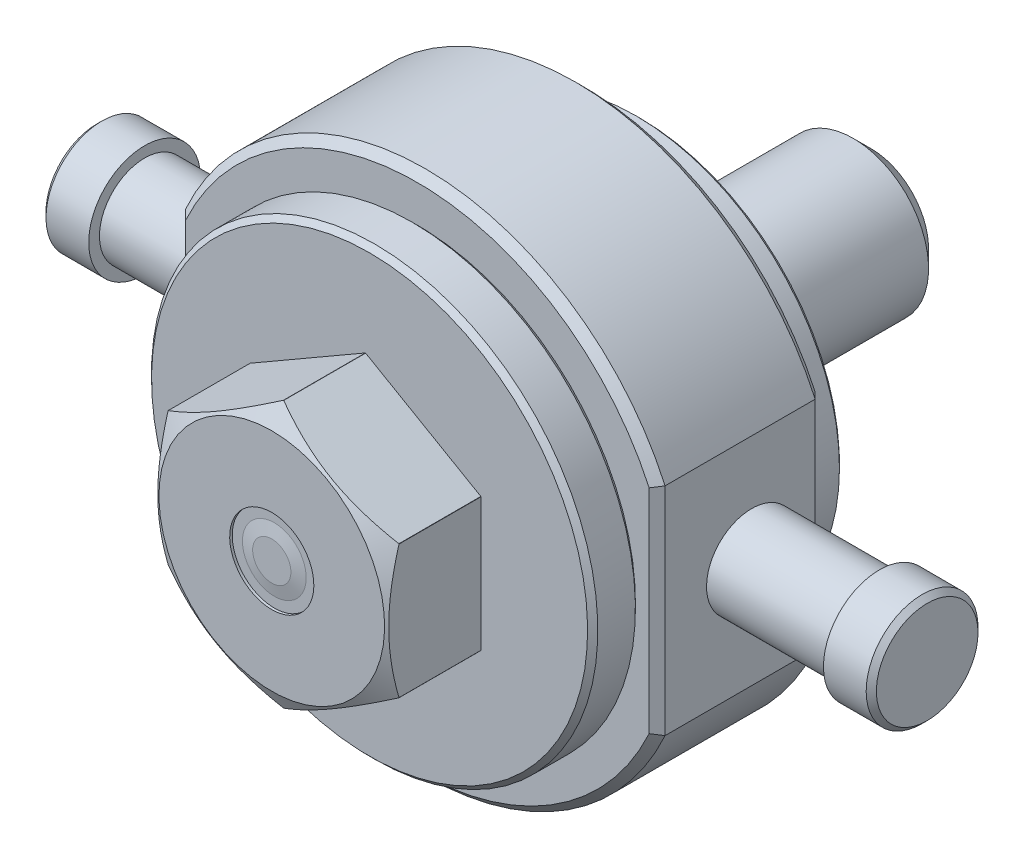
ISO-10303-21;
HEADER;
FILE_DESCRIPTION(('STEP AP214'),'2;1');
FILE_NAME('part.step','',(''),(''),'','','');
FILE_SCHEMA(('AUTOMOTIVE_DESIGN { 1 0 10303 214 1 1 1 1 }'));
ENDSEC;
DATA;
#1=APPLICATION_CONTEXT('core data for automotive mechanical design processes');
#2=APPLICATION_PROTOCOL_DEFINITION('international standard','automotive_design',2000,#1);
#3=PRODUCT_CONTEXT('',#1,'mechanical');
#4=PRODUCT('Part','Part','',(#3));
#5=PRODUCT_RELATED_PRODUCT_CATEGORY('part','',(#4));
#6=PRODUCT_DEFINITION_FORMATION('','',#4);
#7=PRODUCT_DEFINITION_CONTEXT('part definition',#1,'design');
#8=PRODUCT_DEFINITION('design','',#6,#7);
#9=PRODUCT_DEFINITION_SHAPE('','',#8);
#10=(LENGTH_UNIT() NAMED_UNIT(*) SI_UNIT(.MILLI.,.METRE.));
#11=(NAMED_UNIT(*) PLANE_ANGLE_UNIT() SI_UNIT($,.RADIAN.));
#12=(NAMED_UNIT(*) SI_UNIT($,.STERADIAN.) SOLID_ANGLE_UNIT());
#13=UNCERTAINTY_MEASURE_WITH_UNIT(LENGTH_MEASURE(1.E-05),#10,'distance_accuracy_value','');
#14=(GEOMETRIC_REPRESENTATION_CONTEXT(3) GLOBAL_UNCERTAINTY_ASSIGNED_CONTEXT((#13)) GLOBAL_UNIT_ASSIGNED_CONTEXT((#10,
#11,#12)) REPRESENTATION_CONTEXT('',''));
#15=CARTESIAN_POINT('',(0.,0.,0.));
#16=DIRECTION('',(0.,0.,1.));
#17=DIRECTION('',(1.,0.,0.));
#18=AXIS2_PLACEMENT_3D('',#15,#16,#17);
#19=CARTESIAN_POINT('',(0.,0.,-48.));
#20=DIRECTION('',(0.,0.,1.));
#21=DIRECTION('',(0.,-1.,0.));
#22=AXIS2_PLACEMENT_3D('',#19,#20,#21);
#23=CYLINDRICAL_SURFACE('',#22,15.);
#24=CARTESIAN_POINT('',(0.,0.,-42.5));
#25=DIRECTION('',(0.,0.,-1.));
#26=DIRECTION('',(-1.,0.,0.));
#27=AXIS2_PLACEMENT_3D('',#24,#25,#26);
#28=CIRCLE('',#27,15.);
#29=CARTESIAN_POINT('',(-15.,0.,-42.5));
#30=VERTEX_POINT('',#29);
#31=EDGE_CURVE('E9',#30,#30,#28,.F.);
#32=ORIENTED_EDGE('',*,*,#31,.T.);
#33=EDGE_LOOP('',(#32));
#34=FACE_BOUND('',#33,.T.);
#35=CARTESIAN_POINT('',(0.,0.,0.));
#36=DIRECTION('',(0.,0.,-1.));
#37=DIRECTION('',(0.,1.,0.));
#38=AXIS2_PLACEMENT_3D('',#35,#36,#37);
#39=CIRCLE('',#38,15.);
#40=CARTESIAN_POINT('',(0.,15.,0.));
#41=VERTEX_POINT('',#40);
#42=EDGE_CURVE('E465',#41,#41,#39,.T.);
#43=ORIENTED_EDGE('',*,*,#42,.T.);
#44=EDGE_LOOP('',(#43));
#45=FACE_BOUND('',#44,.T.);
#46=ADVANCED_FACE('F14',(#34,#45),#23,.T.);
#47=CARTESIAN_POINT('',(0.,-22.479,73.3298));
#48=DIRECTION('',(0.,0.,-1.));
#49=DIRECTION('',(0.,1.,0.));
#50=AXIS2_PLACEMENT_3D('',#47,#48,#49);
#51=PLANE('',#50);
#52=CARTESIAN_POINT('',(0.,0.,73.3298000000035));
#53=DIRECTION('',(0.,0.,-1.));
#54=DIRECTION('',(0.,1.,0.));
#55=AXIS2_PLACEMENT_3D('',#52,#53,#54);
#56=CIRCLE('',#55,3.80999999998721);
#57=CARTESIAN_POINT('',(0.,3.80999999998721,73.3298000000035));
#58=VERTEX_POINT('',#57);
#59=EDGE_CURVE('E437',#58,#58,#56,.T.);
#60=ORIENTED_EDGE('',*,*,#59,.F.);
#61=EDGE_LOOP('',(#60));
#62=FACE_BOUND('',#61,.T.);
#63=ADVANCED_FACE('F568',(#62),#51,.F.);
#64=CARTESIAN_POINT('',(0.,0.,72.8218000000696));
#65=DIRECTION('',(0.,0.,-1.));
#66=DIRECTION('',(0.,1.,0.));
#67=AXIS2_PLACEMENT_3D('',#64,#65,#66);
#68=CONICAL_SURFACE('',#67,6.34999999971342,1.37340076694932);
#69=ORIENTED_EDGE('',*,*,#59,.T.);
#70=EDGE_LOOP('',(#69));
#71=FACE_BOUND('',#70,.T.);
#72=CARTESIAN_POINT('',(0.,0.,72.8218000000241));
#73=DIRECTION('',(0.,0.,-1.));
#74=DIRECTION('',(0.,1.,0.));
#75=AXIS2_PLACEMENT_3D('',#72,#73,#74);
#76=CIRCLE('',#75,6.34999999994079);
#77=CARTESIAN_POINT('',(0.,6.34999999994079,72.8218000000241));
#78=VERTEX_POINT('',#77);
#79=EDGE_CURVE('E434',#78,#78,#76,.T.);
#80=ORIENTED_EDGE('',*,*,#79,.F.);
#81=EDGE_LOOP('',(#80));
#82=FACE_BOUND('',#81,.T.);
#83=ADVANCED_FACE('F575',(#71,#82),#68,.T.);
#84=CARTESIAN_POINT('',(-6.35,0.,72.8218));
#85=DIRECTION('',(0.,0.,1.));
#86=DIRECTION('',(0.,-1.,0.));
#87=AXIS2_PLACEMENT_3D('',#84,#85,#86);
#88=PLANE('',#87);
#89=CARTESIAN_POINT('',(0.,0.,72.8218));
#90=DIRECTION('',(0.,0.,-1.));
#91=DIRECTION('',(0.,1.,0.));
#92=AXIS2_PLACEMENT_3D('',#89,#90,#91);
#93=CIRCLE('',#92,8.382);
#94=CARTESIAN_POINT('',(0.,8.382,72.8218));
#95=VERTEX_POINT('',#94);
#96=EDGE_CURVE('E431',#95,#95,#93,.F.);
#97=ORIENTED_EDGE('',*,*,#96,.T.);
#98=EDGE_LOOP('',(#97));
#99=FACE_BOUND('',#98,.T.);
#100=ORIENTED_EDGE('',*,*,#79,.T.);
#101=EDGE_LOOP('',(#100));
#102=FACE_BOUND('',#101,.T.);
#103=ADVANCED_FACE('F1023',(#99,#102),#88,.T.);
#104=CARTESIAN_POINT('',(0.,0.,-6.4008));
#105=DIRECTION('',(0.,0.,-1.));
#106=DIRECTION('',(0.,1.,0.));
#107=AXIS2_PLACEMENT_3D('',#104,#105,#106);
#108=CYLINDRICAL_SURFACE('',#107,8.382);
#109=CARTESIAN_POINT('',(0.,0.,73.3298));
#110=DIRECTION('',(0.,0.,-1.));
#111=DIRECTION('',(0.,1.,0.));
#112=AXIS2_PLACEMENT_3D('',#109,#110,#111);
#113=CIRCLE('',#112,8.382);
#114=CARTESIAN_POINT('',(0.,8.382,73.3298));
#115=VERTEX_POINT('',#114);
#116=EDGE_CURVE('E160',#115,#115,#113,.F.);
#117=ORIENTED_EDGE('',*,*,#116,.T.);
#118=EDGE_LOOP('',(#117));
#119=FACE_BOUND('',#118,.T.);
#120=ORIENTED_EDGE('',*,*,#96,.F.);
#121=EDGE_LOOP('',(#120));
#122=FACE_BOUND('',#121,.T.);
#123=ADVANCED_FACE('F1012',(#119,#122),#108,.F.);
#124=CARTESIAN_POINT('',(0.,-22.479,73.3298));
#125=DIRECTION('',(0.,0.,-1.));
#126=DIRECTION('',(0.,1.,0.));
#127=AXIS2_PLACEMENT_3D('',#124,#125,#126);
#128=PLANE('',#127);
#129=ORIENTED_EDGE('',*,*,#116,.F.);
#130=EDGE_LOOP('',(#129));
#131=FACE_BOUND('',#130,.T.);
#132=CARTESIAN_POINT('',(0.,0.,73.3298));
#133=DIRECTION('',(0.,0.,-1.));
#134=DIRECTION('',(0.,1.,0.));
#135=AXIS2_PLACEMENT_3D('',#132,#133,#134);
#136=CIRCLE('',#135,22.479);
#137=CARTESIAN_POINT('',(0.,22.479,73.3298));
#138=VERTEX_POINT('',#137);
#139=EDGE_CURVE('E413',#138,#138,#136,.T.);
#140=ORIENTED_EDGE('',*,*,#139,.F.);
#141=EDGE_LOOP('',(#140));
#142=FACE_BOUND('',#141,.T.);
#143=ADVANCED_FACE('F1003',(#131,#142),#128,.F.);
#144=CARTESIAN_POINT('',(0.,0.,103.709609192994));
#145=DIRECTION('',(0.,0.,1.));
#146=DIRECTION('',(0.,-1.,0.));
#147=AXIS2_PLACEMENT_3D('',#144,#145,#146);
#148=CYLINDRICAL_SURFACE('',#147,26.543);
#149=DIRECTION('',(0.,0.,1.));
#150=VECTOR('',#149,1.);
#151=CARTESIAN_POINT('',(0.0255967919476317,26.5429876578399,-46.228));
#152=LINE('',#151,#150);
#153=CARTESIAN_POINT('',(0.0255967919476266,26.5429876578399,54.6608));
#154=VERTEX_POINT('',#153);
#155=CARTESIAN_POINT('',(0.0255967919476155,26.5429876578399,70.9834485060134));
#156=VERTEX_POINT('',#155);
#157=EDGE_CURVE('E157',#154,#156,#152,.T.);
#158=ORIENTED_EDGE('',*,*,#157,.F.);
#159=CARTESIAN_POINT('',(0.,0.,54.6608));
#160=DIRECTION('',(0.,0.,1.));
#161=DIRECTION('',(0.,-1.,0.));
#162=AXIS2_PLACEMENT_3D('',#159,#160,#161);
#163=CIRCLE('',#162,26.543);
#164=CARTESIAN_POINT('',(-0.0255967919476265,26.5429876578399,54.6608));
#165=VERTEX_POINT('',#164);
#166=EDGE_CURVE('E149',#154,#165,#163,.T.);
#167=ORIENTED_EDGE('',*,*,#166,.T.);
#168=DIRECTION('',(0.,0.,1.));
#169=VECTOR('',#168,1.);
#170=CARTESIAN_POINT('',(-0.025596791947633,26.54298765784,-46.228));
#171=LINE('',#170,#169);
#172=CARTESIAN_POINT('',(-0.0255967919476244,26.5429876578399,70.9834485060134));
#173=VERTEX_POINT('',#172);
#174=EDGE_CURVE('E155',#173,#165,#171,.F.);
#175=ORIENTED_EDGE('',*,*,#174,.F.);
#176=CARTESIAN_POINT('',(0.,0.,70.9834485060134));
#177=DIRECTION('',(0.,0.,-1.));
#178=DIRECTION('',(1.,0.,0.));
#179=AXIS2_PLACEMENT_3D('',#176,#177,#178);
#180=CIRCLE('',#179,26.543);
#181=EDGE_CURVE('E187',#156,#173,#180,.F.);
#182=ORIENTED_EDGE('',*,*,#181,.F.);
#183=EDGE_LOOP('',(#158,#167,#175,#182));
#184=FACE_BOUND('',#183,.T.);
#185=ADVANCED_FACE('F154',(#184),#148,.T.);
#186=CARTESIAN_POINT('',(0.,0.,103.709609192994));
#187=DIRECTION('',(0.,0.,1.));
#188=DIRECTION('',(0.,-1.,0.));
#189=AXIS2_PLACEMENT_3D('',#186,#187,#188);
#190=CYLINDRICAL_SURFACE('',#189,26.543);
#191=DIRECTION('',(0.,0.,1.));
#192=VECTOR('',#191,1.);
#193=CARTESIAN_POINT('',(-22.9741032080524,13.293661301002,-46.228));
#194=LINE('',#193,#192);
#195=CARTESIAN_POINT('',(-22.9741032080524,13.293661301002,54.6608));
#196=VERTEX_POINT('',#195);
#197=CARTESIAN_POINT('',(-22.9741032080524,13.293661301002,70.9834485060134));
#198=VERTEX_POINT('',#197);
#199=EDGE_CURVE('E170',#196,#198,#194,.T.);
#200=ORIENTED_EDGE('',*,*,#199,.F.);
#201=CARTESIAN_POINT('',(0.,0.,54.6608));
#202=DIRECTION('',(0.,0.,1.));
#203=DIRECTION('',(0.,-1.,0.));
#204=AXIS2_PLACEMENT_3D('',#201,#202,#203);
#205=CIRCLE('',#204,26.543);
#206=CARTESIAN_POINT('',(-22.9997,13.2493263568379,54.6608));
#207=VERTEX_POINT('',#206);
#208=EDGE_CURVE('E159',#196,#207,#205,.T.);
#209=ORIENTED_EDGE('',*,*,#208,.T.);
#210=DIRECTION('',(0.,0.,1.));
#211=VECTOR('',#210,1.);
#212=CARTESIAN_POINT('',(-22.9997,13.2493263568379,-46.228));
#213=LINE('',#212,#211);
#214=CARTESIAN_POINT('',(-22.9997,13.2493263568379,70.9834485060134));
#215=VERTEX_POINT('',#214);
#216=EDGE_CURVE('E384',#215,#207,#213,.F.);
#217=ORIENTED_EDGE('',*,*,#216,.F.);
#218=CARTESIAN_POINT('',(0.,0.,70.9834485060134));
#219=DIRECTION('',(0.,0.,-1.));
#220=DIRECTION('',(1.,0.,0.));
#221=AXIS2_PLACEMENT_3D('',#218,#219,#220);
#222=CIRCLE('',#221,26.543);
#223=EDGE_CURVE('E186',#198,#215,#222,.F.);
#224=ORIENTED_EDGE('',*,*,#223,.F.);
#225=EDGE_LOOP('',(#200,#209,#217,#224));
#226=FACE_BOUND('',#225,.T.);
#227=ADVANCED_FACE('F985',(#226),#190,.T.);
#228=CARTESIAN_POINT('',(0.,0.,103.709609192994));
#229=DIRECTION('',(0.,0.,1.));
#230=DIRECTION('',(0.,-1.,0.));
#231=AXIS2_PLACEMENT_3D('',#228,#229,#230);
#232=CYLINDRICAL_SURFACE('',#231,26.543);
#233=DIRECTION('',(0.,0.,1.));
#234=VECTOR('',#233,1.);
#235=CARTESIAN_POINT('',(-22.9997,-13.2493263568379,-46.228));
#236=LINE('',#235,#234);
#237=CARTESIAN_POINT('',(-22.9997,-13.2493263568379,54.6608));
#238=VERTEX_POINT('',#237);
#239=CARTESIAN_POINT('',(-22.9997,-13.2493263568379,70.9834485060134));
#240=VERTEX_POINT('',#239);
#241=EDGE_CURVE('E381',#238,#240,#236,.T.);
#242=ORIENTED_EDGE('',*,*,#241,.F.);
#243=CARTESIAN_POINT('',(0.,0.,54.6608));
#244=DIRECTION('',(0.,0.,1.));
#245=DIRECTION('',(0.,-1.,0.));
#246=AXIS2_PLACEMENT_3D('',#243,#244,#245);
#247=CIRCLE('',#246,26.543);
#248=CARTESIAN_POINT('',(-22.9741032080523,-13.293661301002,54.6608));
#249=VERTEX_POINT('',#248);
#250=EDGE_CURVE('E426',#238,#249,#247,.T.);
#251=ORIENTED_EDGE('',*,*,#250,.T.);
#252=DIRECTION('',(0.,0.,1.));
#253=VECTOR('',#252,1.);
#254=CARTESIAN_POINT('',(-22.9741032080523,-13.293661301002,-46.228));
#255=LINE('',#254,#253);
#256=CARTESIAN_POINT('',(-22.9741032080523,-13.293661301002,70.9834485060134));
#257=VERTEX_POINT('',#256);
#258=EDGE_CURVE('E377',#257,#249,#255,.F.);
#259=ORIENTED_EDGE('',*,*,#258,.F.);
#260=CARTESIAN_POINT('',(0.,0.,70.9834485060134));
#261=DIRECTION('',(0.,0.,-1.));
#262=DIRECTION('',(1.,0.,0.));
#263=AXIS2_PLACEMENT_3D('',#260,#261,#262);
#264=CIRCLE('',#263,26.543);
#265=EDGE_CURVE('E410',#240,#257,#264,.F.);
#266=ORIENTED_EDGE('',*,*,#265,.F.);
#267=EDGE_LOOP('',(#242,#251,#259,#266));
#268=FACE_BOUND('',#267,.T.);
#269=ADVANCED_FACE('F976',(#268),#232,.T.);
#270=CARTESIAN_POINT('',(0.,0.,103.709609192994));
#271=DIRECTION('',(0.,0.,1.));
#272=DIRECTION('',(0.,-1.,0.));
#273=AXIS2_PLACEMENT_3D('',#270,#271,#272);
#274=CYLINDRICAL_SURFACE('',#273,26.543);
#275=DIRECTION('',(0.,0.,1.));
#276=VECTOR('',#275,1.);
#277=CARTESIAN_POINT('',(-0.0255967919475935,-26.5429876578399,-46.228));
#278=LINE('',#277,#276);
#279=CARTESIAN_POINT('',(-0.0255967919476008,-26.5429876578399,54.6608));
#280=VERTEX_POINT('',#279);
#281=CARTESIAN_POINT('',(-0.0255967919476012,-26.5429876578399,70.9834485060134));
#282=VERTEX_POINT('',#281);
#283=EDGE_CURVE('E374',#280,#282,#278,.T.);
#284=ORIENTED_EDGE('',*,*,#283,.F.);
#285=CARTESIAN_POINT('',(0.,0.,54.6608));
#286=DIRECTION('',(0.,0.,1.));
#287=DIRECTION('',(0.,-1.,0.));
#288=AXIS2_PLACEMENT_3D('',#285,#286,#287);
#289=CIRCLE('',#288,26.543);
#290=CARTESIAN_POINT('',(0.0255967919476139,-26.5429876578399,54.6608));
#291=VERTEX_POINT('',#290);
#292=EDGE_CURVE('E188',#280,#291,#289,.T.);
#293=ORIENTED_EDGE('',*,*,#292,.T.);
#294=DIRECTION('',(0.,0.,1.));
#295=VECTOR('',#294,1.);
#296=CARTESIAN_POINT('',(0.0255967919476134,-26.5429876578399,-46.228));
#297=LINE('',#296,#295);
#298=CARTESIAN_POINT('',(0.0255967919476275,-26.5429876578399,70.9834485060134));
#299=VERTEX_POINT('',#298);
#300=EDGE_CURVE('E370',#299,#291,#297,.F.);
#301=ORIENTED_EDGE('',*,*,#300,.F.);
#302=CARTESIAN_POINT('',(0.,0.,70.9834485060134));
#303=DIRECTION('',(0.,0.,-1.));
#304=DIRECTION('',(1.,0.,0.));
#305=AXIS2_PLACEMENT_3D('',#302,#303,#304);
#306=CIRCLE('',#305,26.543);
#307=EDGE_CURVE('E406',#282,#299,#306,.F.);
#308=ORIENTED_EDGE('',*,*,#307,.F.);
#309=EDGE_LOOP('',(#284,#293,#301,#308));
#310=FACE_BOUND('',#309,.T.);
#311=ADVANCED_FACE('F522',(#310),#274,.T.);
#312=CARTESIAN_POINT('',(0.,0.,70.9834485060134));
#313=DIRECTION('',(0.,0.,-1.));
#314=DIRECTION('',(0.,1.,0.));
#315=AXIS2_PLACEMENT_3D('',#312,#313,#314);
#316=CONICAL_SURFACE('',#315,26.543,1.0471975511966);
#317=CARTESIAN_POINT('',(-22.9997,-13.2493263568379,70.9834485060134));
#318=CARTESIAN_POINT('',(-22.9997,-12.7053409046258,71.1402097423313));
#319=CARTESIAN_POINT('',(-22.9997,-12.1593846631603,71.290313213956));
#320=CARTESIAN_POINT('',(-22.9997,-11.0634161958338,71.5754876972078));
#321=CARTESIAN_POINT('',(-22.9997,-10.51340294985,71.710554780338));
#322=CARTESIAN_POINT('',(-22.9997,-9.40830915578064,71.9641268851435));
#323=CARTESIAN_POINT('',(-22.9997,-8.85322028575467,72.0825958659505));
#324=CARTESIAN_POINT('',(-22.9997,-7.73938029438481,72.3007989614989));
#325=CARTESIAN_POINT('',(-22.9997,-7.18062934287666,72.40053393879));
#326=CARTESIAN_POINT('',(-22.9997,-6.07279368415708,72.5774544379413));
#327=CARTESIAN_POINT('',(-22.9997,-5.52378409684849,72.655107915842));
#328=CARTESIAN_POINT('',(-22.9997,-4.42317883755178,72.7894095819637));
#329=CARTESIAN_POINT('',(-22.9997,-3.87158313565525,72.8460575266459));
#330=CARTESIAN_POINT('',(-22.9997,-2.76713129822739,72.937132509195));
#331=CARTESIAN_POINT('',(-22.9997,-2.21427709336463,72.9715828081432));
#332=CARTESIAN_POINT('',(-22.9997,-1.10761525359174,73.0176033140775));
#333=CARTESIAN_POINT('',(-22.9997,-0.553807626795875,73.029173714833));
#334=CARTESIAN_POINT('',(-22.9997,0.553807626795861,73.029173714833));
#335=CARTESIAN_POINT('',(-22.9997,1.10761525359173,73.0176033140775));
#336=CARTESIAN_POINT('',(-22.9997,2.21427709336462,72.9715828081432));
#337=CARTESIAN_POINT('',(-22.9997,2.76713129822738,72.937132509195));
#338=CARTESIAN_POINT('',(-22.9997,3.87158313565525,72.8460575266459));
#339=CARTESIAN_POINT('',(-22.9997,4.42317883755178,72.7894095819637));
#340=CARTESIAN_POINT('',(-22.9997,5.52378409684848,72.655107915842));
#341=CARTESIAN_POINT('',(-22.9997,6.07279368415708,72.5774544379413));
#342=CARTESIAN_POINT('',(-22.9997,7.18062934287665,72.40053393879));
#343=CARTESIAN_POINT('',(-22.9997,7.7393802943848,72.3007989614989));
#344=CARTESIAN_POINT('',(-22.9997,8.85322028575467,72.0825958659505));
#345=CARTESIAN_POINT('',(-22.9997,9.40830915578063,71.9641268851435));
#346=CARTESIAN_POINT('',(-22.9997,10.51340294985,71.710554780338));
#347=CARTESIAN_POINT('',(-22.9997,11.0634161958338,71.5754876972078));
#348=CARTESIAN_POINT('',(-22.9997,12.1593846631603,71.290313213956));
#349=CARTESIAN_POINT('',(-22.9997,12.7053409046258,71.1402097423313));
#350=CARTESIAN_POINT('',(-22.9997,13.2493263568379,70.9834485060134));
#351=B_SPLINE_CURVE_WITH_KNOTS('',3,(#317,#318,#319,#320,#321,#322,#323,#324,#325,#326,#327,
#328,#329,#330,#331,#332,#333,#334,#335,#336,#337,#338,#339,#340,#341,#342,#343,#344,#345,#346,
#347,#348,#349,#350),.UNSPECIFIED.,.F.,.F.,(4,2,2,2,2,2,2,2,2,2,2,2,2,2,2,2,4),(0.,
1.69839859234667,3.39723988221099,5.09971466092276,6.8021110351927,8.46515517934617,
10.1282186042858,11.7895364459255,13.4508402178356,15.1121439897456,16.7734618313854,
18.436525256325,20.0995694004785,21.8019657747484,23.5044405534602,25.2032818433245,
26.9016804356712),.UNSPECIFIED.);
#352=EDGE_CURVE('E387',#240,#215,#351,.T.);
#353=ORIENTED_EDGE('',*,*,#352,.F.);
#354=ORIENTED_EDGE('',*,*,#265,.T.);
#355=CARTESIAN_POINT('',(-0.0255967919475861,-26.54298765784,70.9834485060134));
#356=CARTESIAN_POINT('',(-0.53090319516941,-26.2512488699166,71.151588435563));
#357=CARTESIAN_POINT('',(-1.03818040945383,-25.9583722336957,71.3120734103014));
#358=CARTESIAN_POINT('',(-2.0567998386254,-25.3702720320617,71.6156100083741));
#359=CARTESIAN_POINT('',(-2.56814333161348,-25.0750477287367,71.7586558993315));
#360=CARTESIAN_POINT('',(-3.59588495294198,-24.4816808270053,72.025388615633));
#361=CARTESIAN_POINT('',(-4.11229209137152,-24.1835330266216,72.1490294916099));
#362=CARTESIAN_POINT('',(-5.14866461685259,-23.5851830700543,72.3742879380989));
#363=CARTESIAN_POINT('',(-5.66862964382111,-23.2849811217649,72.4759077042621));
#364=CARTESIAN_POINT('',(-6.69885277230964,-22.6901815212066,72.6528146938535));
#365=CARTESIAN_POINT('',(-7.20903488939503,-22.3956277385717,72.7286883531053));
#366=CARTESIAN_POINT('',(-8.23172439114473,-21.8051776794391,72.8557877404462));
#367=CARTESIAN_POINT('',(-8.74423182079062,-21.5092813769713,72.907012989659));
#368=CARTESIAN_POINT('',(-9.77009639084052,-20.9169981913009,72.9835224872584));
#369=CARTESIAN_POINT('',(-10.2834518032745,-20.6206123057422,73.0088374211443));
#370=CARTESIAN_POINT('',(-11.3106220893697,-20.0275752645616,73.0329827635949));
#371=CARTESIAN_POINT('',(-11.8244369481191,-19.730924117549,73.0318140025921));
#372=CARTESIAN_POINT('',(-12.7833352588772,-19.1773039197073,73.0049432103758));
#373=CARTESIAN_POINT('',(-13.2284903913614,-18.9202934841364,72.982517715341));
#374=CARTESIAN_POINT('',(-14.1177357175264,-18.4068874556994,72.9182161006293));
#375=CARTESIAN_POINT('',(-14.561825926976,-18.1504918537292,72.8763402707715));
#376=CARTESIAN_POINT('',(-15.4487779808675,-17.6384098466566,72.7738574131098));
#377=CARTESIAN_POINT('',(-15.8916383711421,-17.3827242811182,72.7132336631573));
#378=CARTESIAN_POINT('',(-16.7752469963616,-16.8725726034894,72.5743185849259));
#379=CARTESIAN_POINT('',(-17.2159952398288,-16.6181064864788,72.4960273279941));
#380=CARTESIAN_POINT('',(-18.553915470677,-15.8456578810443,72.2326515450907));
#381=CARTESIAN_POINT('',(-19.4473043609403,-15.3298595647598,72.0213953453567));
#382=CARTESIAN_POINT('',(-20.777574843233,-14.5618275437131,71.6618364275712));
#383=CARTESIAN_POINT('',(-21.2189861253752,-14.306978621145,71.5349988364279));
#384=CARTESIAN_POINT('',(-22.098769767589,-13.7990352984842,71.2684998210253));
#385=CARTESIAN_POINT('',(-22.5371429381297,-13.545940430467,71.128841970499));
#386=CARTESIAN_POINT('',(-22.9741032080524,-13.293661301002,70.9834485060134));
#387=B_SPLINE_CURVE_WITH_KNOTS('',3,(#355,#356,#357,#358,#359,#360,#361,#362,#363,#364,#365,
#366,#367,#368,#369,#370,#371,#372,#373,#374,#375,#376,#377,#378,#379,#380,#381,#382,#383,#384,
#385,#386),.UNSPECIFIED.,.F.,.F.,(4,2,2,2,2,2,2,2,2,2,2,2,2,2,2,4),(0.,1.82171002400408,
3.64401725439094,5.47057648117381,7.2969535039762,9.07838868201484,10.8598584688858,
12.6392160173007,14.4185177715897,15.9616782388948,17.5048157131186,19.0493335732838,
20.5938451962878,23.7505009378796,25.3261115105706,26.9012841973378),.UNSPECIFIED.);
#388=EDGE_CURVE('E380',#282,#257,#387,.T.);
#389=ORIENTED_EDGE('',*,*,#388,.F.);
#390=ORIENTED_EDGE('',*,*,#307,.T.);
#391=CARTESIAN_POINT('',(22.9741032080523,-13.293661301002,70.9834485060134));
#392=CARTESIAN_POINT('',(22.4687968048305,-13.5854000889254,71.151588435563));
#393=CARTESIAN_POINT('',(21.9615195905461,-13.8782767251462,71.3120734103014));
#394=CARTESIAN_POINT('',(20.9429001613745,-14.4663769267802,71.6156100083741));
#395=CARTESIAN_POINT('',(20.4315566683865,-14.7616012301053,71.7586558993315));
#396=CARTESIAN_POINT('',(19.403815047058,-15.3549681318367,72.025388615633));
#397=CARTESIAN_POINT('',(18.8874079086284,-15.6531159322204,72.1490294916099));
#398=CARTESIAN_POINT('',(17.8510353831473,-16.2514658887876,72.3742879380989));
#399=CARTESIAN_POINT('',(17.3310703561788,-16.5516678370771,72.4759077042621));
#400=CARTESIAN_POINT('',(16.3008472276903,-17.1464674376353,72.6528146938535));
#401=CARTESIAN_POINT('',(15.7906651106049,-17.4410212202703,72.7286883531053));
#402=CARTESIAN_POINT('',(14.7679756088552,-18.0314712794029,72.8557877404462));
#403=CARTESIAN_POINT('',(14.2554681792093,-18.3273675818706,72.907012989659));
#404=CARTESIAN_POINT('',(13.2296036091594,-18.919650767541,72.9835224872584));
#405=CARTESIAN_POINT('',(12.7162481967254,-19.2160366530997,73.0088374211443));
#406=CARTESIAN_POINT('',(11.6890779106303,-19.8090736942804,73.0329827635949));
#407=CARTESIAN_POINT('',(11.1752630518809,-20.105724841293,73.0318140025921));
#408=CARTESIAN_POINT('',(10.2163647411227,-20.6593450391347,73.0049432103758));
#409=CARTESIAN_POINT('',(9.77120960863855,-20.9163554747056,72.982517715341));
#410=CARTESIAN_POINT('',(8.88196428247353,-21.4297615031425,72.9182161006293));
#411=CARTESIAN_POINT('',(8.43787407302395,-21.6861571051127,72.8763402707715));
#412=CARTESIAN_POINT('',(7.55092201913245,-22.1982391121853,72.7738574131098));
#413=CARTESIAN_POINT('',(7.10806162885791,-22.4539246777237,72.7132336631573));
#414=CARTESIAN_POINT('',(6.22445300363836,-22.9640763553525,72.5743185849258));
#415=CARTESIAN_POINT('',(5.78370476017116,-23.2185424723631,72.496027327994));
#416=CARTESIAN_POINT('',(4.44578452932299,-23.9909910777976,72.2326515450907));
#417=CARTESIAN_POINT('',(3.55239563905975,-24.5067893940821,72.0213953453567));
#418=CARTESIAN_POINT('',(2.22212515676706,-25.2748214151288,71.6618364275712));
#419=CARTESIAN_POINT('',(1.78071387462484,-25.5296703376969,71.5349988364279));
#420=CARTESIAN_POINT('',(0.900930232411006,-26.0376136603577,71.2684998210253));
#421=CARTESIAN_POINT('',(0.462557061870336,-26.2907085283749,71.128841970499));
#422=CARTESIAN_POINT('',(0.0255967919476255,-26.5429876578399,70.9834485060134));
#423=B_SPLINE_CURVE_WITH_KNOTS('',3,(#391,#392,#393,#394,#395,#396,#397,#398,#399,#400,#401,
#402,#403,#404,#405,#406,#407,#408,#409,#410,#411,#412,#413,#414,#415,#416,#417,#418,#419,#420,
#421,#422),.UNSPECIFIED.,.F.,.F.,(4,2,2,2,2,2,2,2,2,2,2,2,2,2,2,4),(0.,1.82171002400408,
3.64401725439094,5.47057648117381,7.29695350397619,9.07838868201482,10.8598584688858,
12.6392160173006,14.4185177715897,15.9616782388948,17.5048157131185,19.0493335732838,
20.5938451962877,23.7505009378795,25.3261115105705,26.9012841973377),.UNSPECIFIED.);
#424=CARTESIAN_POINT('',(22.9741032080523,-13.293661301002,70.9834485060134));
#425=VERTEX_POINT('',#424);
#426=EDGE_CURVE('E373',#425,#299,#423,.T.);
#427=ORIENTED_EDGE('',*,*,#426,.F.);
#428=CARTESIAN_POINT('',(0.,0.,70.9834485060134));
#429=DIRECTION('',(0.,0.,1.));
#430=DIRECTION('',(0.,-1.,0.));
#431=AXIS2_PLACEMENT_3D('',#428,#429,#430);
#432=CIRCLE('',#431,26.543);
#433=CARTESIAN_POINT('',(22.9997,-13.2493263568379,70.9834485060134));
#434=VERTEX_POINT('',#433);
#435=EDGE_CURVE('E403',#434,#425,#432,.F.);
#436=ORIENTED_EDGE('',*,*,#435,.F.);
#437=CARTESIAN_POINT('',(22.9997,13.2493263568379,70.9834485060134));
#438=CARTESIAN_POINT('',(22.9997,12.7053409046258,71.1402097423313));
#439=CARTESIAN_POINT('',(22.9997,12.1593846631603,71.290313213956));
#440=CARTESIAN_POINT('',(22.9997,11.0634161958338,71.5754876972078));
#441=CARTESIAN_POINT('',(22.9997,10.51340294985,71.710554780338));
#442=CARTESIAN_POINT('',(22.9997,9.40830915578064,71.9641268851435));
#443=CARTESIAN_POINT('',(22.9997,8.85322028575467,72.0825958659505));
#444=CARTESIAN_POINT('',(22.9997,7.7393802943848,72.3007989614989));
#445=CARTESIAN_POINT('',(22.9997,7.18062934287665,72.40053393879));
#446=CARTESIAN_POINT('',(22.9997,6.07279368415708,72.5774544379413));
#447=CARTESIAN_POINT('',(22.9997,5.52378409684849,72.655107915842));
#448=CARTESIAN_POINT('',(22.9997,4.42317883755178,72.7894095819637));
#449=CARTESIAN_POINT('',(22.9997,3.87158313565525,72.8460575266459));
#450=CARTESIAN_POINT('',(22.9997,2.76713129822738,72.937132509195));
#451=CARTESIAN_POINT('',(22.9997,2.21427709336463,72.9715828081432));
#452=CARTESIAN_POINT('',(22.9997,1.10761525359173,73.0176033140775));
#453=CARTESIAN_POINT('',(22.9997,0.553807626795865,73.029173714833));
#454=CARTESIAN_POINT('',(22.9997,-0.553807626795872,73.029173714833));
#455=CARTESIAN_POINT('',(22.9997,-1.10761525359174,73.0176033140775));
#456=CARTESIAN_POINT('',(22.9997,-2.21427709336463,72.9715828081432));
#457=CARTESIAN_POINT('',(22.9997,-2.76713129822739,72.937132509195));
#458=CARTESIAN_POINT('',(22.9997,-3.87158313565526,72.8460575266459));
#459=CARTESIAN_POINT('',(22.9997,-4.42317883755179,72.7894095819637));
#460=CARTESIAN_POINT('',(22.9997,-5.5237840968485,72.655107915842));
#461=CARTESIAN_POINT('',(22.9997,-6.07279368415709,72.5774544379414));
#462=CARTESIAN_POINT('',(22.9997,-7.18062934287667,72.40053393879));
#463=CARTESIAN_POINT('',(22.9997,-7.73938029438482,72.3007989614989));
#464=CARTESIAN_POINT('',(22.9997,-8.85322028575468,72.0825958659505));
#465=CARTESIAN_POINT('',(22.9997,-9.40830915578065,71.9641268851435));
#466=CARTESIAN_POINT('',(22.9997,-10.51340294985,71.710554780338));
#467=CARTESIAN_POINT('',(22.9997,-11.0634161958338,71.5754876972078));
#468=CARTESIAN_POINT('',(22.9997,-12.1593846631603,71.290313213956));
#469=CARTESIAN_POINT('',(22.9997,-12.7053409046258,71.1402097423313));
#470=CARTESIAN_POINT('',(22.9997,-13.2493263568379,70.9834485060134));
#471=B_SPLINE_CURVE_WITH_KNOTS('',3,(#437,#438,#439,#440,#441,#442,#443,#444,#445,#446,#447,
#448,#449,#450,#451,#452,#453,#454,#455,#456,#457,#458,#459,#460,#461,#462,#463,#464,#465,#466,
#467,#468,#469,#470),.UNSPECIFIED.,.F.,.F.,(4,2,2,2,2,2,2,2,2,2,2,2,2,2,2,2,4),(0.,
1.69839859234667,3.39723988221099,5.09971466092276,6.80211103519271,8.46515517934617,
10.1282186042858,11.7895364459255,13.4508402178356,15.1121439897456,16.7734618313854,
18.436525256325,20.0995694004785,21.8019657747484,23.5044405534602,25.2032818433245,
26.9016804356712),.UNSPECIFIED.);
#472=CARTESIAN_POINT('',(22.9997,13.2493263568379,70.9834485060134));
#473=VERTEX_POINT('',#472);
#474=EDGE_CURVE('E366',#473,#434,#471,.T.);
#475=ORIENTED_EDGE('',*,*,#474,.F.);
#476=CARTESIAN_POINT('',(0.,0.,70.9834485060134));
#477=DIRECTION('',(0.,0.,1.));
#478=DIRECTION('',(0.,-1.,0.));
#479=AXIS2_PLACEMENT_3D('',#476,#477,#478);
#480=CIRCLE('',#479,26.543);
#481=CARTESIAN_POINT('',(22.9741032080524,13.293661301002,70.9834485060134));
#482=VERTEX_POINT('',#481);
#483=EDGE_CURVE('E394',#482,#473,#480,.F.);
#484=ORIENTED_EDGE('',*,*,#483,.F.);
#485=CARTESIAN_POINT('',(0.0255967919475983,26.5429876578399,70.9834485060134));
#486=CARTESIAN_POINT('',(0.530903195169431,26.2512488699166,71.151588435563));
#487=CARTESIAN_POINT('',(1.03818040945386,25.9583722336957,71.3120734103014));
#488=CARTESIAN_POINT('',(2.05679983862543,25.3702720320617,71.6156100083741));
#489=CARTESIAN_POINT('',(2.5681433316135,25.0750477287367,71.7586558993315));
#490=CARTESIAN_POINT('',(3.595884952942,24.4816808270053,72.025388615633));
#491=CARTESIAN_POINT('',(4.11229209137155,24.1835330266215,72.1490294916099));
#492=CARTESIAN_POINT('',(5.14866461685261,23.5851830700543,72.3742879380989));
#493=CARTESIAN_POINT('',(5.66862964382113,23.2849811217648,72.4759077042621));
#494=CARTESIAN_POINT('',(6.69885277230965,22.6901815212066,72.6528146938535));
#495=CARTESIAN_POINT('',(7.20903488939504,22.3956277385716,72.7286883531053));
#496=CARTESIAN_POINT('',(8.23172439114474,21.805177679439,72.8557877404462));
#497=CARTESIAN_POINT('',(8.74423182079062,21.5092813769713,72.907012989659));
#498=CARTESIAN_POINT('',(9.77009639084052,20.9169981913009,72.9835224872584));
#499=CARTESIAN_POINT('',(10.2834518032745,20.6206123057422,73.0088374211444));
#500=CARTESIAN_POINT('',(11.3106220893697,20.0275752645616,73.0329827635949));
#501=CARTESIAN_POINT('',(11.8244369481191,19.730924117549,73.0318140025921));
#502=CARTESIAN_POINT('',(12.7833352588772,19.1773039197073,73.0049432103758));
#503=CARTESIAN_POINT('',(13.2284903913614,18.9202934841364,72.982517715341));
#504=CARTESIAN_POINT('',(14.1177357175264,18.4068874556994,72.9182161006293));
#505=CARTESIAN_POINT('',(14.561825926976,18.1504918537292,72.8763402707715));
#506=CARTESIAN_POINT('',(15.4487779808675,17.6384098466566,72.7738574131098));
#507=CARTESIAN_POINT('',(15.8916383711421,17.3827242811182,72.7132336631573));
#508=CARTESIAN_POINT('',(16.7752469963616,16.8725726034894,72.5743185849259));
#509=CARTESIAN_POINT('',(17.2159952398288,16.6181064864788,72.4960273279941));
#510=CARTESIAN_POINT('',(18.553915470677,15.8456578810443,72.2326515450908));
#511=CARTESIAN_POINT('',(19.4473043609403,15.3298595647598,72.0213953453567));
#512=CARTESIAN_POINT('',(20.777574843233,14.5618275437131,71.6618364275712));
#513=CARTESIAN_POINT('',(21.2189861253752,14.306978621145,71.5349988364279));
#514=CARTESIAN_POINT('',(22.098769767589,13.7990352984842,71.2684998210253));
#515=CARTESIAN_POINT('',(22.5371429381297,13.545940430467,71.128841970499));
#516=CARTESIAN_POINT('',(22.9741032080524,13.293661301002,70.9834485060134));
#517=B_SPLINE_CURVE_WITH_KNOTS('',3,(#485,#486,#487,#488,#489,#490,#491,#492,#493,#494,#495,
#496,#497,#498,#499,#500,#501,#502,#503,#504,#505,#506,#507,#508,#509,#510,#511,#512,#513,#514,
#515,#516),.UNSPECIFIED.,.F.,.F.,(4,2,2,2,2,2,2,2,2,2,2,2,2,2,2,4),(0.,1.82171002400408,
3.64401725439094,5.47057648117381,7.29695350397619,9.07838868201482,10.8598584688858,
12.6392160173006,14.4185177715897,15.9616782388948,17.5048157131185,19.0493335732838,
20.5938451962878,23.7505009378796,25.3261115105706,26.9012841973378),.UNSPECIFIED.);
#518=EDGE_CURVE('E393',#156,#482,#517,.T.);
#519=ORIENTED_EDGE('',*,*,#518,.F.);
#520=ORIENTED_EDGE('',*,*,#181,.T.);
#521=CARTESIAN_POINT('',(-22.9741032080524,13.293661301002,70.9834485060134));
#522=CARTESIAN_POINT('',(-22.4687968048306,13.5854000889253,71.151588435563));
#523=CARTESIAN_POINT('',(-21.9615195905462,13.8782767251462,71.3120734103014));
#524=CARTESIAN_POINT('',(-20.9429001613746,14.4663769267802,71.6156100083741));
#525=CARTESIAN_POINT('',(-20.4315566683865,14.7616012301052,71.7586558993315));
#526=CARTESIAN_POINT('',(-19.403815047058,15.3549681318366,72.025388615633));
#527=CARTESIAN_POINT('',(-18.8874079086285,15.6531159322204,72.1490294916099));
#528=CARTESIAN_POINT('',(-17.8510353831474,16.2514658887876,72.3742879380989));
#529=CARTESIAN_POINT('',(-17.3310703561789,16.5516678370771,72.4759077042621));
#530=CARTESIAN_POINT('',(-16.3008472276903,17.1464674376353,72.6528146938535));
#531=CARTESIAN_POINT('',(-15.790665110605,17.4410212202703,72.7286883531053));
#532=CARTESIAN_POINT('',(-14.7679756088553,18.0314712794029,72.8557877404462));
#533=CARTESIAN_POINT('',(-14.2554681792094,18.3273675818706,72.907012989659));
#534=CARTESIAN_POINT('',(-13.2296036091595,18.919650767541,72.9835224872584));
#535=CARTESIAN_POINT('',(-12.7162481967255,19.2160366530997,73.0088374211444));
#536=CARTESIAN_POINT('',(-11.6890779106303,19.8090736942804,73.0329827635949));
#537=CARTESIAN_POINT('',(-11.1752630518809,20.1057248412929,73.0318140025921));
#538=CARTESIAN_POINT('',(-10.2163647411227,20.6593450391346,73.0049432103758));
#539=CARTESIAN_POINT('',(-9.77120960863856,20.9163554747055,72.982517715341));
#540=CARTESIAN_POINT('',(-8.88196428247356,21.4297615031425,72.9182161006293));
#541=CARTESIAN_POINT('',(-8.43787407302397,21.6861571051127,72.8763402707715));
#542=CARTESIAN_POINT('',(-7.55092201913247,22.1982391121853,72.7738574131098));
#543=CARTESIAN_POINT('',(-7.10806162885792,22.4539246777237,72.7132336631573));
#544=CARTESIAN_POINT('',(-6.22445300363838,22.9640763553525,72.5743185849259));
#545=CARTESIAN_POINT('',(-5.78370476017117,23.2185424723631,72.4960273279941));
#546=CARTESIAN_POINT('',(-4.44578452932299,23.9909910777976,72.2326515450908));
#547=CARTESIAN_POINT('',(-3.55239563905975,24.5067893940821,72.0213953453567));
#548=CARTESIAN_POINT('',(-2.22212515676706,25.2748214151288,71.6618364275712));
#549=CARTESIAN_POINT('',(-1.78071387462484,25.5296703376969,71.5349988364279));
#550=CARTESIAN_POINT('',(-0.900930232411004,26.0376136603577,71.2684998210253));
#551=CARTESIAN_POINT('',(-0.462557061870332,26.2907085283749,71.128841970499));
#552=CARTESIAN_POINT('',(-0.0255967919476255,26.5429876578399,70.9834485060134));
#553=B_SPLINE_CURVE_WITH_KNOTS('',3,(#521,#522,#523,#524,#525,#526,#527,#528,#529,#530,#531,
#532,#533,#534,#535,#536,#537,#538,#539,#540,#541,#542,#543,#544,#545,#546,#547,#548,#549,#550,
#551,#552),.UNSPECIFIED.,.F.,.F.,(4,2,2,2,2,2,2,2,2,2,2,2,2,2,2,4),(0.,1.82171002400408,
3.64401725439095,5.47057648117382,7.29695350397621,9.07838868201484,10.8598584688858,
12.6392160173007,14.4185177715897,15.9616782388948,17.5048157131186,19.0493335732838,
20.5938451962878,23.7505009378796,25.3261115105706,26.9012841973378),.UNSPECIFIED.);
#554=EDGE_CURVE('E169',#198,#173,#553,.T.);
#555=ORIENTED_EDGE('',*,*,#554,.F.);
#556=ORIENTED_EDGE('',*,*,#223,.T.);
#557=EDGE_LOOP('',(#353,#354,#389,#390,#427,#436,#475,#484,#519,#520,#555,#556));
#558=FACE_BOUND('',#557,.T.);
#559=ORIENTED_EDGE('',*,*,#139,.T.);
#560=EDGE_LOOP('',(#559));
#561=FACE_BOUND('',#560,.T.);
#562=ADVANCED_FACE('F516',(#558,#561),#316,.T.);
#563=CARTESIAN_POINT('',(0.,0.,103.709609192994));
#564=DIRECTION('',(0.,0.,1.));
#565=DIRECTION('',(0.,-1.,0.));
#566=AXIS2_PLACEMENT_3D('',#563,#564,#565);
#567=CYLINDRICAL_SURFACE('',#566,26.543);
#568=DIRECTION('',(0.,0.,1.));
#569=VECTOR('',#568,1.);
#570=CARTESIAN_POINT('',(22.9741032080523,-13.293661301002,-46.228));
#571=LINE('',#570,#569);
#572=CARTESIAN_POINT('',(22.9741032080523,-13.293661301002,54.6608));
#573=VERTEX_POINT('',#572);
#574=EDGE_CURVE('E367',#573,#425,#571,.T.);
#575=ORIENTED_EDGE('',*,*,#574,.F.);
#576=CARTESIAN_POINT('',(0.,0.,54.6608));
#577=DIRECTION('',(0.,0.,1.));
#578=DIRECTION('',(0.,-1.,0.));
#579=AXIS2_PLACEMENT_3D('',#576,#577,#578);
#580=CIRCLE('',#579,26.543);
#581=CARTESIAN_POINT('',(22.9997,-13.2493263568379,54.6608));
#582=VERTEX_POINT('',#581);
#583=EDGE_CURVE('E405',#573,#582,#580,.T.);
#584=ORIENTED_EDGE('',*,*,#583,.T.);
#585=DIRECTION('',(0.,0.,1.));
#586=VECTOR('',#585,1.);
#587=CARTESIAN_POINT('',(22.9997,-13.2493263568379,-46.228));
#588=LINE('',#587,#586);
#589=EDGE_CURVE('E363',#434,#582,#588,.F.);
#590=ORIENTED_EDGE('',*,*,#589,.F.);
#591=ORIENTED_EDGE('',*,*,#435,.T.);
#592=EDGE_LOOP('',(#575,#584,#590,#591));
#593=FACE_BOUND('',#592,.T.);
#594=ADVANCED_FACE('F521',(#593),#567,.T.);
#595=CARTESIAN_POINT('',(0.,0.,103.709609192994));
#596=DIRECTION('',(0.,0.,1.));
#597=DIRECTION('',(0.,-1.,0.));
#598=AXIS2_PLACEMENT_3D('',#595,#596,#597);
#599=CYLINDRICAL_SURFACE('',#598,26.543);
#600=DIRECTION('',(0.,0.,1.));
#601=VECTOR('',#600,1.);
#602=CARTESIAN_POINT('',(22.9741032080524,13.293661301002,-46.228));
#603=LINE('',#602,#601);
#604=CARTESIAN_POINT('',(22.9741032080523,13.293661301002,54.6608));
#605=VERTEX_POINT('',#604);
#606=EDGE_CURVE('E390',#482,#605,#603,.F.);
#607=ORIENTED_EDGE('',*,*,#606,.F.);
#608=ORIENTED_EDGE('',*,*,#483,.T.);
#609=DIRECTION('',(0.,0.,1.));
#610=VECTOR('',#609,1.);
#611=CARTESIAN_POINT('',(22.9997,13.2493263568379,-46.228));
#612=LINE('',#611,#610);
#613=CARTESIAN_POINT('',(22.9997,13.2493263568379,54.6608));
#614=VERTEX_POINT('',#613);
#615=EDGE_CURVE('E182',#614,#473,#612,.T.);
#616=ORIENTED_EDGE('',*,*,#615,.F.);
#617=CARTESIAN_POINT('',(0.,0.,54.6608));
#618=DIRECTION('',(0.,0.,1.));
#619=DIRECTION('',(0.,-1.,0.));
#620=AXIS2_PLACEMENT_3D('',#617,#618,#619);
#621=CIRCLE('',#620,26.543);
#622=EDGE_CURVE('E397',#614,#605,#621,.T.);
#623=ORIENTED_EDGE('',*,*,#622,.T.);
#624=EDGE_LOOP('',(#607,#608,#616,#623));
#625=FACE_BOUND('',#624,.T.);
#626=ADVANCED_FACE('F556',(#625),#599,.T.);
#627=CARTESIAN_POINT('',(22.9997,13.2788829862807,-46.228));
#628=DIRECTION('',(0.5,0.866025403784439,0.));
#629=DIRECTION('',(-0.866025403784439,0.5,0.));
#630=AXIS2_PLACEMENT_3D('',#627,#628,#629);
#631=PLANE('',#630);
#632=DIRECTION('',(-0.866025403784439,0.5,0.));
#633=VECTOR('',#632,1.);
#634=CARTESIAN_POINT('',(22.9741032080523,13.293661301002,54.6608));
#635=LINE('',#634,#633);
#636=EDGE_CURVE('E177',#605,#154,#635,.T.);
#637=ORIENTED_EDGE('',*,*,#636,.T.);
#638=ORIENTED_EDGE('',*,*,#157,.T.);
#639=ORIENTED_EDGE('',*,*,#518,.T.);
#640=ORIENTED_EDGE('',*,*,#606,.T.);
#641=EDGE_LOOP('',(#637,#638,#639,#640));
#642=FACE_BOUND('',#641,.T.);
#643=ADVANCED_FACE('F553',(#642),#631,.T.);
#644=CARTESIAN_POINT('',(0.,26.5577659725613,-46.228));
#645=DIRECTION('',(-0.5,0.866025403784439,0.));
#646=DIRECTION('',(-0.866025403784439,-0.5,0.));
#647=AXIS2_PLACEMENT_3D('',#644,#645,#646);
#648=PLANE('',#647);
#649=DIRECTION('',(-0.866025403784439,-0.5,0.));
#650=VECTOR('',#649,1.);
#651=CARTESIAN_POINT('',(-0.0255967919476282,26.5429876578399,54.6608));
#652=LINE('',#651,#650);
#653=EDGE_CURVE('E167',#165,#196,#652,.T.);
#654=ORIENTED_EDGE('',*,*,#653,.T.);
#655=ORIENTED_EDGE('',*,*,#199,.T.);
#656=ORIENTED_EDGE('',*,*,#554,.T.);
#657=ORIENTED_EDGE('',*,*,#174,.T.);
#658=EDGE_LOOP('',(#654,#655,#656,#657));
#659=FACE_BOUND('',#658,.T.);
#660=ADVANCED_FACE('F165',(#659),#648,.T.);
#661=CARTESIAN_POINT('',(-22.9997,13.2788829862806,-46.228));
#662=DIRECTION('',(-1.,0.,0.));
#663=DIRECTION('',(0.,-1.,0.));
#664=AXIS2_PLACEMENT_3D('',#661,#662,#663);
#665=PLANE('',#664);
#666=DIRECTION('',(0.,-1.,0.));
#667=VECTOR('',#666,1.);
#668=CARTESIAN_POINT('',(-22.9997,-21.336,54.6608));
#669=LINE('',#668,#667);
#670=EDGE_CURVE('E176',#207,#238,#669,.T.);
#671=ORIENTED_EDGE('',*,*,#670,.T.);
#672=ORIENTED_EDGE('',*,*,#241,.T.);
#673=ORIENTED_EDGE('',*,*,#352,.T.);
#674=ORIENTED_EDGE('',*,*,#216,.T.);
#675=EDGE_LOOP('',(#671,#672,#673,#674));
#676=FACE_BOUND('',#675,.T.);
#677=ADVANCED_FACE('F930',(#676),#665,.T.);
#678=CARTESIAN_POINT('',(-22.9997,-13.2788829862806,-46.228));
#679=DIRECTION('',(-0.5,-0.866025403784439,0.));
#680=DIRECTION('',(0.866025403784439,-0.5,0.));
#681=AXIS2_PLACEMENT_3D('',#678,#679,#680);
#682=PLANE('',#681);
#683=DIRECTION('',(0.866025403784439,-0.5,0.));
#684=VECTOR('',#683,1.);
#685=CARTESIAN_POINT('',(-22.9741032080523,-13.293661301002,54.6608));
#686=LINE('',#685,#684);
#687=EDGE_CURVE('E180',#249,#280,#686,.T.);
#688=ORIENTED_EDGE('',*,*,#687,.T.);
#689=ORIENTED_EDGE('',*,*,#283,.T.);
#690=ORIENTED_EDGE('',*,*,#388,.T.);
#691=ORIENTED_EDGE('',*,*,#258,.T.);
#692=EDGE_LOOP('',(#688,#689,#690,#691));
#693=FACE_BOUND('',#692,.T.);
#694=ADVANCED_FACE('F921',(#693),#682,.T.);
#695=CARTESIAN_POINT('',(0.,-26.5577659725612,-46.228));
#696=DIRECTION('',(0.5,-0.866025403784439,0.));
#697=DIRECTION('',(0.866025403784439,0.5,0.));
#698=AXIS2_PLACEMENT_3D('',#695,#696,#697);
#699=PLANE('',#698);
#700=DIRECTION('',(0.866025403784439,0.5,0.));
#701=VECTOR('',#700,1.);
#702=CARTESIAN_POINT('',(0.0255967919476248,-26.5429876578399,54.6608));
#703=LINE('',#702,#701);
#704=EDGE_CURVE('E402',#291,#573,#703,.T.);
#705=ORIENTED_EDGE('',*,*,#704,.T.);
#706=ORIENTED_EDGE('',*,*,#574,.T.);
#707=ORIENTED_EDGE('',*,*,#426,.T.);
#708=ORIENTED_EDGE('',*,*,#300,.T.);
#709=EDGE_LOOP('',(#705,#706,#707,#708));
#710=FACE_BOUND('',#709,.T.);
#711=ADVANCED_FACE('F912',(#710),#699,.T.);
#712=CARTESIAN_POINT('',(22.9997,-13.2788829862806,-46.228));
#713=DIRECTION('',(1.,0.,0.));
#714=DIRECTION('',(0.,0.,1.));
#715=AXIS2_PLACEMENT_3D('',#712,#713,#714);
#716=PLANE('',#715);
#717=DIRECTION('',(0.,-1.,0.));
#718=VECTOR('',#717,1.);
#719=CARTESIAN_POINT('',(22.9997,-21.336,54.6608));
#720=LINE('',#719,#718);
#721=EDGE_CURVE('E398',#582,#614,#720,.F.);
#722=ORIENTED_EDGE('',*,*,#721,.T.);
#723=ORIENTED_EDGE('',*,*,#615,.T.);
#724=ORIENTED_EDGE('',*,*,#474,.T.);
#725=ORIENTED_EDGE('',*,*,#589,.T.);
#726=EDGE_LOOP('',(#722,#723,#724,#725));
#727=FACE_BOUND('',#726,.T.);
#728=ADVANCED_FACE('F513',(#727),#716,.T.);
#729=CARTESIAN_POINT('',(0.,-21.336,54.6608));
#730=DIRECTION('',(0.,0.,1.));
#731=DIRECTION('',(0.,-1.,0.));
#732=AXIS2_PLACEMENT_3D('',#729,#730,#731);
#733=PLANE('',#732);
#734=ORIENTED_EDGE('',*,*,#583,.F.);
#735=ORIENTED_EDGE('',*,*,#704,.F.);
#736=ORIENTED_EDGE('',*,*,#292,.F.);
#737=ORIENTED_EDGE('',*,*,#687,.F.);
#738=ORIENTED_EDGE('',*,*,#250,.F.);
#739=ORIENTED_EDGE('',*,*,#670,.F.);
#740=ORIENTED_EDGE('',*,*,#208,.F.);
#741=ORIENTED_EDGE('',*,*,#653,.F.);
#742=ORIENTED_EDGE('',*,*,#166,.F.);
#743=ORIENTED_EDGE('',*,*,#636,.F.);
#744=ORIENTED_EDGE('',*,*,#622,.F.);
#745=ORIENTED_EDGE('',*,*,#721,.F.);
#746=EDGE_LOOP('',(#734,#735,#736,#737,#738,#739,#740,#741,#742,#743,#744,#745));
#747=FACE_BOUND('',#746,.T.);
#748=CARTESIAN_POINT('',(0.,0.,54.6608));
#749=DIRECTION('',(0.,0.,1.));
#750=DIRECTION('',(0.,-1.,0.));
#751=AXIS2_PLACEMENT_3D('',#748,#749,#750);
#752=CIRCLE('',#751,21.336);
#753=CARTESIAN_POINT('',(0.,-21.336,54.6608));
#754=VERTEX_POINT('',#753);
#755=EDGE_CURVE('E360',#754,#754,#752,.F.);
#756=ORIENTED_EDGE('',*,*,#755,.F.);
#757=EDGE_LOOP('',(#756));
#758=FACE_BOUND('',#757,.T.);
#759=ADVANCED_FACE('F172',(#747,#758),#733,.F.);
#760=CARTESIAN_POINT('',(0.,0.,103.709609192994));
#761=DIRECTION('',(0.,0.,1.));
#762=DIRECTION('',(0.,-1.,0.));
#763=AXIS2_PLACEMENT_3D('',#760,#761,#762);
#764=CYLINDRICAL_SURFACE('',#763,21.336);
#765=CARTESIAN_POINT('',(0.,0.,53.848));
#766=DIRECTION('',(0.,0.,1.));
#767=DIRECTION('',(0.,-1.,0.));
#768=AXIS2_PLACEMENT_3D('',#765,#766,#767);
#769=CIRCLE('',#768,21.336);
#770=CARTESIAN_POINT('',(0.,-21.336,53.848));
#771=VERTEX_POINT('',#770);
#772=EDGE_CURVE('E356',#771,#771,#769,.F.);
#773=ORIENTED_EDGE('',*,*,#772,.F.);
#774=EDGE_LOOP('',(#773));
#775=FACE_BOUND('',#774,.T.);
#776=ORIENTED_EDGE('',*,*,#755,.T.);
#777=EDGE_LOOP('',(#776));
#778=FACE_BOUND('',#777,.T.);
#779=ADVANCED_FACE('F625',(#775,#778),#764,.T.);
#780=CARTESIAN_POINT('',(43.3691313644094,2.37293082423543,53.848));
#781=DIRECTION('',(0.,0.,1.));
#782=DIRECTION('',(0.,-1.,0.));
#783=AXIS2_PLACEMENT_3D('',#780,#781,#782);
#784=PLANE('',#783);
#785=ORIENTED_EDGE('',*,*,#772,.T.);
#786=EDGE_LOOP('',(#785));
#787=FACE_BOUND('',#786,.T.);
#788=CARTESIAN_POINT('',(0.,0.,53.848));
#789=DIRECTION('',(0.,0.,-1.));
#790=DIRECTION('',(0.,1.,0.));
#791=AXIS2_PLACEMENT_3D('',#788,#789,#790);
#792=CIRCLE('',#791,43.434);
#793=CARTESIAN_POINT('',(0.,43.434,53.848));
#794=VERTEX_POINT('',#793);
#795=EDGE_CURVE('E352',#794,#794,#792,.T.);
#796=ORIENTED_EDGE('',*,*,#795,.F.);
#797=EDGE_LOOP('',(#796));
#798=FACE_BOUND('',#797,.T.);
#799=ADVANCED_FACE('F622',(#787,#798),#784,.T.);
#800=CARTESIAN_POINT('',(0.,0.,52.832));
#801=DIRECTION('',(0.,0.,-1.));
#802=DIRECTION('',(0.,1.,0.));
#803=AXIS2_PLACEMENT_3D('',#800,#801,#802);
#804=CONICAL_SURFACE('',#803,44.45,0.785398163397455);
#805=ORIENTED_EDGE('',*,*,#795,.T.);
#806=EDGE_LOOP('',(#805));
#807=FACE_BOUND('',#806,.T.);
#808=CARTESIAN_POINT('',(0.,0.,52.832));
#809=DIRECTION('',(0.,0.,-1.));
#810=DIRECTION('',(0.,1.,0.));
#811=AXIS2_PLACEMENT_3D('',#808,#809,#810);
#812=CIRCLE('',#811,44.45);
#813=CARTESIAN_POINT('',(0.,44.45,52.832));
#814=VERTEX_POINT('',#813);
#815=EDGE_CURVE('E349',#814,#814,#812,.T.);
#816=ORIENTED_EDGE('',*,*,#815,.F.);
#817=EDGE_LOOP('',(#816));
#818=FACE_BOUND('',#817,.T.);
#819=ADVANCED_FACE('F474',(#807,#818),#804,.T.);
#820=CARTESIAN_POINT('',(0.,0.,0.));
#821=DIRECTION('',(0.,0.,-1.));
#822=DIRECTION('',(0.,1.,0.));
#823=AXIS2_PLACEMENT_3D('',#820,#821,#822);
#824=PLANE('',#823);
#825=ORIENTED_EDGE('',*,*,#42,.F.);
#826=EDGE_LOOP('',(#825));
#827=FACE_BOUND('',#826,.T.);
#828=CARTESIAN_POINT('',(0.,0.,0.));
#829=DIRECTION('',(0.,0.,1.));
#830=DIRECTION('',(0.,-1.,0.));
#831=AXIS2_PLACEMENT_3D('',#828,#829,#830);
#832=CIRCLE('',#831,39.751);
#833=CARTESIAN_POINT('',(0.,-39.751,0.));
#834=VERTEX_POINT('',#833);
#835=EDGE_CURVE('E348',#834,#834,#832,.T.);
#836=ORIENTED_EDGE('',*,*,#835,.F.);
#837=EDGE_LOOP('',(#836));
#838=FACE_BOUND('',#837,.T.);
#839=ADVANCED_FACE('F470',(#827,#838),#824,.T.);
#840=CARTESIAN_POINT('',(0.,0.,44.323));
#841=DIRECTION('',(0.,0.,-1.));
#842=DIRECTION('',(0.,1.,0.));
#843=AXIS2_PLACEMENT_3D('',#840,#841,#842);
#844=CYLINDRICAL_SURFACE('',#843,44.45);
#845=ORIENTED_EDGE('',*,*,#815,.T.);
#846=EDGE_LOOP('',(#845));
#847=FACE_BOUND('',#846,.T.);
#848=CARTESIAN_POINT('',(0.,0.,45.339));
#849=DIRECTION('',(0.,0.,1.));
#850=DIRECTION('',(0.0546330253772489,-0.998506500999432,0.));
#851=AXIS2_PLACEMENT_3D('',#848,#849,#850);
#852=CIRCLE('',#851,44.45);
#853=CARTESIAN_POINT('',(2.42843797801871,-44.3836139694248,45.339));
#854=VERTEX_POINT('',#853);
#855=EDGE_CURVE('E345',#854,#854,#852,.F.);
#856=ORIENTED_EDGE('',*,*,#855,.F.);
#857=EDGE_LOOP('',(#856));
#858=FACE_BOUND('',#857,.T.);
#859=ADVANCED_FACE('F473',(#847,#858),#844,.T.);
#860=CARTESIAN_POINT('',(0.,0.,0.762));
#861=DIRECTION('',(0.,0.,1.));
#862=DIRECTION('',(0.,-1.,0.));
#863=AXIS2_PLACEMENT_3D('',#860,#861,#862);
#864=CONICAL_SURFACE('',#863,40.513,0.785398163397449);
#865=ORIENTED_EDGE('',*,*,#835,.T.);
#866=EDGE_LOOP('',(#865));
#867=FACE_BOUND('',#866,.T.);
#868=CARTESIAN_POINT('',(0.,0.,0.762));
#869=DIRECTION('',(0.,0.,-1.));
#870=DIRECTION('',(0.,1.,0.));
#871=AXIS2_PLACEMENT_3D('',#868,#869,#870);
#872=CIRCLE('',#871,40.513);
#873=CARTESIAN_POINT('',(0.,40.513,0.762));
#874=VERTEX_POINT('',#873);
#875=EDGE_CURVE('E342',#874,#874,#872,.F.);
#876=ORIENTED_EDGE('',*,*,#875,.F.);
#877=EDGE_LOOP('',(#876));
#878=FACE_BOUND('',#877,.T.);
#879=ADVANCED_FACE('F850',(#867,#878),#864,.T.);
#880=CARTESIAN_POINT('',(0.,0.,45.339));
#881=DIRECTION('',(0.,0.,1.));
#882=DIRECTION('',(0.,-1.,0.));
#883=AXIS2_PLACEMENT_3D('',#880,#881,#882);
#884=CONICAL_SURFACE('',#883,44.45,0.785398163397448);
#885=CARTESIAN_POINT('',(0.,0.,44.323));
#886=DIRECTION('',(0.,0.,1.));
#887=DIRECTION('',(0.,-1.,0.));
#888=AXIS2_PLACEMENT_3D('',#885,#886,#887);
#889=CIRCLE('',#888,43.434);
#890=CARTESIAN_POINT('',(0.,-43.434,44.323));
#891=VERTEX_POINT('',#890);
#892=EDGE_CURVE('E341',#891,#891,#889,.F.);
#893=ORIENTED_EDGE('',*,*,#892,.F.);
#894=EDGE_LOOP('',(#893));
#895=FACE_BOUND('',#894,.T.);
#896=ORIENTED_EDGE('',*,*,#855,.T.);
#897=EDGE_LOOP('',(#896));
#898=FACE_BOUND('',#897,.T.);
#899=ADVANCED_FACE('F840',(#895,#898),#884,.T.);
#900=CARTESIAN_POINT('',(0.,0.,0.));
#901=DIRECTION('',(0.,0.,-1.));
#902=DIRECTION('',(0.,1.,0.));
#903=AXIS2_PLACEMENT_3D('',#900,#901,#902);
#904=CYLINDRICAL_SURFACE('',#903,40.513);
#905=CARTESIAN_POINT('',(0.,0.,9.9568));
#906=DIRECTION('',(0.,0.,-1.));
#907=DIRECTION('',(0.,1.,0.));
#908=AXIS2_PLACEMENT_3D('',#905,#906,#907);
#909=CIRCLE('',#908,40.513);
#910=CARTESIAN_POINT('',(0.,40.513,9.9568));
#911=VERTEX_POINT('',#910);
#912=EDGE_CURVE('E337',#911,#911,#909,.F.);
#913=ORIENTED_EDGE('',*,*,#912,.F.);
#914=EDGE_LOOP('',(#913));
#915=FACE_BOUND('',#914,.T.);
#916=ORIENTED_EDGE('',*,*,#875,.T.);
#917=EDGE_LOOP('',(#916));
#918=FACE_BOUND('',#917,.T.);
#919=ADVANCED_FACE('F830',(#915,#918),#904,.T.);
#920=CARTESIAN_POINT('',(0.,0.,44.323));
#921=DIRECTION('',(0.,0.,1.));
#922=DIRECTION('',(0.,-1.,0.));
#923=AXIS2_PLACEMENT_3D('',#920,#921,#922);
#924=PLANE('',#923);
#925=CARTESIAN_POINT('',(0.,0.,44.323));
#926=DIRECTION('',(0.,0.,-1.));
#927=DIRECTION('',(0.,1.,0.));
#928=AXIS2_PLACEMENT_3D('',#925,#926,#927);
#929=CIRCLE('',#928,50.8);
#930=CARTESIAN_POINT('',(46.1645,-21.2009183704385,44.323));
#931=VERTEX_POINT('',#930);
#932=CARTESIAN_POINT('',(-46.1645,-21.2009183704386,44.323));
#933=VERTEX_POINT('',#932);
#934=EDGE_CURVE('E340',#931,#933,#929,.T.);
#935=ORIENTED_EDGE('',*,*,#934,.F.);
#936=DIRECTION('',(0.,-1.,0.));
#937=VECTOR('',#936,1.);
#938=CARTESIAN_POINT('',(46.1645,0.,44.323));
#939=LINE('',#938,#937);
#940=CARTESIAN_POINT('',(46.1645,21.2009183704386,44.323));
#941=VERTEX_POINT('',#940);
#942=EDGE_CURVE('E332',#941,#931,#939,.T.);
#943=ORIENTED_EDGE('',*,*,#942,.F.);
#944=CARTESIAN_POINT('',(0.,0.,44.323));
#945=DIRECTION('',(0.,0.,-1.));
#946=DIRECTION('',(0.,1.,0.));
#947=AXIS2_PLACEMENT_3D('',#944,#945,#946);
#948=CIRCLE('',#947,50.8);
#949=CARTESIAN_POINT('',(-46.1645,21.2009183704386,44.323));
#950=VERTEX_POINT('',#949);
#951=EDGE_CURVE('E335',#950,#941,#948,.T.);
#952=ORIENTED_EDGE('',*,*,#951,.F.);
#953=DIRECTION('',(0.,-1.,0.));
#954=VECTOR('',#953,1.);
#955=CARTESIAN_POINT('',(-46.1645,0.,44.323));
#956=LINE('',#955,#954);
#957=EDGE_CURVE('E328',#933,#950,#956,.F.);
#958=ORIENTED_EDGE('',*,*,#957,.F.);
#959=EDGE_LOOP('',(#935,#943,#952,#958));
#960=FACE_BOUND('',#959,.T.);
#961=ORIENTED_EDGE('',*,*,#892,.T.);
#962=EDGE_LOOP('',(#961));
#963=FACE_BOUND('',#962,.T.);
#964=ADVANCED_FACE('F820',(#960,#963),#924,.T.);
#965=CARTESIAN_POINT('',(0.,0.,9.9568));
#966=DIRECTION('',(0.,0.,-1.));
#967=DIRECTION('',(0.,1.,0.));
#968=AXIS2_PLACEMENT_3D('',#965,#966,#967);
#969=CONICAL_SURFACE('',#968,40.513,0.785398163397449);
#970=CARTESIAN_POINT('',(0.,0.,10.7188));
#971=DIRECTION('',(0.,0.,-1.));
#972=DIRECTION('',(0.,1.,0.));
#973=AXIS2_PLACEMENT_3D('',#970,#971,#972);
#974=CIRCLE('',#973,39.751);
#975=CARTESIAN_POINT('',(0.,39.751,10.7188));
#976=VERTEX_POINT('',#975);
#977=EDGE_CURVE('E321',#976,#976,#974,.F.);
#978=ORIENTED_EDGE('',*,*,#977,.F.);
#979=EDGE_LOOP('',(#978));
#980=FACE_BOUND('',#979,.T.);
#981=ORIENTED_EDGE('',*,*,#912,.T.);
#982=EDGE_LOOP('',(#981));
#983=FACE_BOUND('',#982,.T.);
#984=ADVANCED_FACE('F810',(#980,#983),#969,.T.);
#985=CARTESIAN_POINT('',(0.,0.,42.7355));
#986=DIRECTION('',(0.,0.,-1.));
#987=DIRECTION('',(0.,1.,0.));
#988=AXIS2_PLACEMENT_3D('',#985,#986,#987);
#989=CONICAL_SURFACE('',#988,52.3875,0.785398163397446);
#990=CARTESIAN_POINT('',(-47.752,-21.5452234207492,42.7355));
#991=CARTESIAN_POINT('',(-47.4873676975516,-21.4882908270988,43.0001323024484));
#992=CARTESIAN_POINT('',(-47.2227598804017,-21.4311324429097,43.2647401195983));
#993=CARTESIAN_POINT('',(-46.6935932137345,-21.3163640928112,43.7939067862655));
#994=CARTESIAN_POINT('',(-46.4290343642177,-21.2587541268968,44.0584656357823));
#995=CARTESIAN_POINT('',(-46.1645,-21.2009183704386,44.323));
#996=B_SPLINE_CURVE_WITH_KNOTS('',3,(#990,#991,#992,#993,#994,#995),.UNSPECIFIED.,.F.,.F.,(4,2,
4),(0.,1.13565622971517,2.27131247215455),.UNSPECIFIED.);
#997=CARTESIAN_POINT('',(-47.752,-21.5452234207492,42.7355));
#998=VERTEX_POINT('',#997);
#999=EDGE_CURVE('E331',#998,#933,#996,.T.);
#1000=ORIENTED_EDGE('',*,*,#999,.F.);
#1001=CARTESIAN_POINT('',(0.,0.,42.7355));
#1002=DIRECTION('',(0.,0.,-1.));
#1003=DIRECTION('',(0.,1.,0.));
#1004=AXIS2_PLACEMENT_3D('',#1001,#1002,#1003);
#1005=CIRCLE('',#1004,52.3875);
#1006=CARTESIAN_POINT('',(47.752,-21.5452234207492,42.7355));
#1007=VERTEX_POINT('',#1006);
#1008=EDGE_CURVE('E319',#1007,#998,#1005,.T.);
#1009=ORIENTED_EDGE('',*,*,#1008,.F.);
#1010=CARTESIAN_POINT('',(46.1645,-21.2009183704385,44.323));
#1011=CARTESIAN_POINT('',(46.4290343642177,-21.2587541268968,44.0584656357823));
#1012=CARTESIAN_POINT('',(46.6935932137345,-21.3163640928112,43.7939067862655));
#1013=CARTESIAN_POINT('',(47.2227598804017,-21.4311324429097,43.2647401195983));
#1014=CARTESIAN_POINT('',(47.4873676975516,-21.4882908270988,43.0001323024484));
#1015=CARTESIAN_POINT('',(47.752,-21.5452234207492,42.7355));
#1016=B_SPLINE_CURVE_WITH_KNOTS('',3,(#1010,#1011,#1012,#1013,#1014,#1015),.UNSPECIFIED.,.F.,
.F.,(4,2,4),(0.,1.13565624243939,2.27131247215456),.UNSPECIFIED.);
#1017=EDGE_CURVE('E336',#931,#1007,#1016,.T.);
#1018=ORIENTED_EDGE('',*,*,#1017,.F.);
#1019=ORIENTED_EDGE('',*,*,#934,.T.);
#1020=EDGE_LOOP('',(#1000,#1009,#1018,#1019));
#1021=FACE_BOUND('',#1020,.T.);
#1022=ADVANCED_FACE('F800',(#1021),#989,.T.);
#1023=CARTESIAN_POINT('',(46.1645,0.,44.323));
#1024=DIRECTION('',(0.707106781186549,0.,0.707106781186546));
#1025=DIRECTION('',(-0.707106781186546,0.,0.707106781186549));
#1026=AXIS2_PLACEMENT_3D('',#1023,#1024,#1025);
#1027=PLANE('',#1026);
#1028=CARTESIAN_POINT('',(46.1645,21.2009183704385,44.323));
#1029=CARTESIAN_POINT('',(46.4290343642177,21.2587541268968,44.0584656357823));
#1030=CARTESIAN_POINT('',(46.6935932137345,21.3163640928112,43.7939067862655));
#1031=CARTESIAN_POINT('',(47.2227598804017,21.4311324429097,43.2647401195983));
#1032=CARTESIAN_POINT('',(47.4873676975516,21.4882908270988,43.0001323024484));
#1033=CARTESIAN_POINT('',(47.752,21.5452234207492,42.7355));
#1034=B_SPLINE_CURVE_WITH_KNOTS('',3,(#1028,#1029,#1030,#1031,#1032,#1033),.UNSPECIFIED.,.F.,
.F.,(4,2,4),(0.,1.13565624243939,2.27131247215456),.UNSPECIFIED.);
#1035=CARTESIAN_POINT('',(47.752,21.5452234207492,42.7355));
#1036=VERTEX_POINT('',#1035);
#1037=EDGE_CURVE('E1142',#941,#1036,#1034,.T.);
#1038=ORIENTED_EDGE('',*,*,#1037,.F.);
#1039=ORIENTED_EDGE('',*,*,#942,.T.);
#1040=ORIENTED_EDGE('',*,*,#1017,.T.);
#1041=DIRECTION('',(0.,-1.,0.));
#1042=VECTOR('',#1041,1.);
#1043=CARTESIAN_POINT('',(47.752,21.5452234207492,42.7355));
#1044=LINE('',#1043,#1042);
#1045=EDGE_CURVE('E271',#1007,#1036,#1044,.F.);
#1046=ORIENTED_EDGE('',*,*,#1045,.T.);
#1047=EDGE_LOOP('',(#1038,#1039,#1040,#1046));
#1048=FACE_BOUND('',#1047,.T.);
#1049=ADVANCED_FACE('F791',(#1048),#1027,.T.);
#1050=CARTESIAN_POINT('',(0.,0.,42.7355));
#1051=DIRECTION('',(0.,0.,-1.));
#1052=DIRECTION('',(0.,1.,0.));
#1053=AXIS2_PLACEMENT_3D('',#1050,#1051,#1052);
#1054=CONICAL_SURFACE('',#1053,52.3875,0.785398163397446);
#1055=ORIENTED_EDGE('',*,*,#1037,.T.);
#1056=CARTESIAN_POINT('',(0.,0.,42.7355));
#1057=DIRECTION('',(0.,0.,-1.));
#1058=DIRECTION('',(0.,1.,0.));
#1059=AXIS2_PLACEMENT_3D('',#1056,#1057,#1058);
#1060=CIRCLE('',#1059,52.3875);
#1061=CARTESIAN_POINT('',(-47.752,21.5452234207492,42.7355));
#1062=VERTEX_POINT('',#1061);
#1063=EDGE_CURVE('E262',#1062,#1036,#1060,.T.);
#1064=ORIENTED_EDGE('',*,*,#1063,.F.);
#1065=CARTESIAN_POINT('',(-46.1645,21.2009183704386,44.323));
#1066=CARTESIAN_POINT('',(-46.4290343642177,21.2587541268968,44.0584656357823));
#1067=CARTESIAN_POINT('',(-46.6935932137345,21.3163640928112,43.7939067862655));
#1068=CARTESIAN_POINT('',(-47.2227598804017,21.4311324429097,43.2647401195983));
#1069=CARTESIAN_POINT('',(-47.4873676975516,21.4882908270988,43.0001323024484));
#1070=CARTESIAN_POINT('',(-47.752,21.5452234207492,42.7355));
#1071=B_SPLINE_CURVE_WITH_KNOTS('',3,(#1065,#1066,#1067,#1068,#1069,#1070),.UNSPECIFIED.,.F.,
.F.,(4,2,4),(0.,1.13565624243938,2.27131247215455),.UNSPECIFIED.);
#1072=EDGE_CURVE('E1134',#950,#1062,#1071,.T.);
#1073=ORIENTED_EDGE('',*,*,#1072,.F.);
#1074=ORIENTED_EDGE('',*,*,#951,.T.);
#1075=EDGE_LOOP('',(#1055,#1064,#1073,#1074));
#1076=FACE_BOUND('',#1075,.T.);
#1077=ADVANCED_FACE('F782',(#1076),#1054,.T.);
#1078=CARTESIAN_POINT('',(-46.1645,0.,44.323));
#1079=DIRECTION('',(-0.707106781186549,0.,0.707106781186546));
#1080=DIRECTION('',(-0.707106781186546,0.,-0.707106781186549));
#1081=AXIS2_PLACEMENT_3D('',#1078,#1079,#1080);
#1082=PLANE('',#1081);
#1083=ORIENTED_EDGE('',*,*,#999,.T.);
#1084=ORIENTED_EDGE('',*,*,#957,.T.);
#1085=ORIENTED_EDGE('',*,*,#1072,.T.);
#1086=DIRECTION('',(0.,1.,0.));
#1087=VECTOR('',#1086,1.);
#1088=CARTESIAN_POINT('',(-47.752,21.5452234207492,42.7355));
#1089=LINE('',#1088,#1087);
#1090=EDGE_CURVE('E245',#1062,#998,#1089,.F.);
#1091=ORIENTED_EDGE('',*,*,#1090,.T.);
#1092=EDGE_LOOP('',(#1083,#1084,#1085,#1091));
#1093=FACE_BOUND('',#1092,.T.);
#1094=ADVANCED_FACE('F294',(#1093),#1082,.T.);
#1095=CARTESIAN_POINT('',(39.751,0.,10.7188));
#1096=DIRECTION('',(0.,0.,1.));
#1097=DIRECTION('',(0.,-1.,0.));
#1098=AXIS2_PLACEMENT_3D('',#1095,#1096,#1097);
#1099=PLANE('',#1098);
#1100=ORIENTED_EDGE('',*,*,#977,.T.);
#1101=EDGE_LOOP('',(#1100));
#1102=FACE_BOUND('',#1101,.T.);
#1103=CARTESIAN_POINT('',(0.,0.,10.7188));
#1104=DIRECTION('',(0.,0.,1.));
#1105=DIRECTION('',(0.,-1.,0.));
#1106=AXIS2_PLACEMENT_3D('',#1103,#1104,#1105);
#1107=CIRCLE('',#1106,25.3111);
#1108=CARTESIAN_POINT('',(0.,25.3111,10.7188));
#1109=VERTEX_POINT('',#1108);
#1110=CARTESIAN_POINT('',(0.,-25.3111,10.7188));
#1111=VERTEX_POINT('',#1110);
#1112=EDGE_CURVE('E248',#1109,#1111,#1107,.F.);
#1113=ORIENTED_EDGE('',*,*,#1112,.T.);
#1114=CARTESIAN_POINT('',(0.,0.,10.7188));
#1115=DIRECTION('',(0.,0.,1.));
#1116=DIRECTION('',(0.,1.,0.));
#1117=AXIS2_PLACEMENT_3D('',#1114,#1115,#1116);
#1118=CIRCLE('',#1117,25.3111);
#1119=EDGE_CURVE('E265',#1111,#1109,#1118,.F.);
#1120=ORIENTED_EDGE('',*,*,#1119,.T.);
#1121=EDGE_LOOP('',(#1113,#1120));
#1122=FACE_BOUND('',#1121,.T.);
#1123=ADVANCED_FACE('F283',(#1102,#1122),#1099,.T.);
#1124=CARTESIAN_POINT('',(0.,0.,44.323));
#1125=DIRECTION('',(0.,0.,-1.));
#1126=DIRECTION('',(0.,1.,0.));
#1127=AXIS2_PLACEMENT_3D('',#1124,#1125,#1126);
#1128=CYLINDRICAL_SURFACE('',#1127,52.3875);
#1129=DIRECTION('',(0.,0.,1.));
#1130=VECTOR('',#1129,1.);
#1131=CARTESIAN_POINT('',(47.752,-21.5452234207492,44.323));
#1132=LINE('',#1131,#1130);
#1133=CARTESIAN_POINT('',(47.752,-21.5452234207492,12.8397));
#1134=VERTEX_POINT('',#1133);
#1135=EDGE_CURVE('E268',#1134,#1007,#1132,.T.);
#1136=ORIENTED_EDGE('',*,*,#1135,.T.);
#1137=ORIENTED_EDGE('',*,*,#1008,.T.);
#1138=DIRECTION('',(0.,0.,1.));
#1139=VECTOR('',#1138,1.);
#1140=CARTESIAN_POINT('',(-47.752,-21.5452234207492,44.323));
#1141=LINE('',#1140,#1139);
#1142=CARTESIAN_POINT('',(-47.752,-21.5452234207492,12.8397));
#1143=VERTEX_POINT('',#1142);
#1144=EDGE_CURVE('E241',#998,#1143,#1141,.F.);
#1145=ORIENTED_EDGE('',*,*,#1144,.T.);
#1146=CARTESIAN_POINT('',(0.,0.,12.8397));
#1147=DIRECTION('',(0.,0.,1.));
#1148=DIRECTION('',(0.,-1.,0.));
#1149=AXIS2_PLACEMENT_3D('',#1146,#1147,#1148);
#1150=CIRCLE('',#1149,52.3875);
#1151=EDGE_CURVE('E259',#1134,#1143,#1150,.F.);
#1152=ORIENTED_EDGE('',*,*,#1151,.F.);
#1153=EDGE_LOOP('',(#1136,#1137,#1145,#1152));
#1154=FACE_BOUND('',#1153,.T.);
#1155=ADVANCED_FACE('F293',(#1154),#1128,.T.);
#1156=CARTESIAN_POINT('',(47.752,21.5452234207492,44.323));
#1157=DIRECTION('',(-1.,0.,0.));
#1158=DIRECTION('',(0.,-1.,0.));
#1159=AXIS2_PLACEMENT_3D('',#1156,#1157,#1158);
#1160=PLANE('',#1159);
#1161=CARTESIAN_POINT('',(47.752,0.,25.4762));
#1162=DIRECTION('',(-1.,0.,0.));
#1163=DIRECTION('',(0.,-1.,0.));
#1164=AXIS2_PLACEMENT_3D('',#1161,#1162,#1163);
#1165=CIRCLE('',#1164,9.);
#1166=CARTESIAN_POINT('',(47.752,-9.00000000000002,25.4762));
#1167=VERTEX_POINT('',#1166);
#1168=EDGE_CURVE('E440',#1167,#1167,#1165,.T.);
#1169=ORIENTED_EDGE('',*,*,#1168,.T.);
#1170=EDGE_LOOP('',(#1169));
#1171=FACE_BOUND('',#1170,.T.);
#1172=DIRECTION('',(0.,-1.,0.));
#1173=VECTOR('',#1172,1.);
#1174=CARTESIAN_POINT('',(47.752,21.5452234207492,12.8397));
#1175=LINE('',#1174,#1173);
#1176=CARTESIAN_POINT('',(47.752,21.5452234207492,12.8397));
#1177=VERTEX_POINT('',#1176);
#1178=EDGE_CURVE('E255',#1134,#1177,#1175,.F.);
#1179=ORIENTED_EDGE('',*,*,#1178,.T.);
#1180=DIRECTION('',(0.,0.,-1.));
#1181=VECTOR('',#1180,1.);
#1182=CARTESIAN_POINT('',(47.752,21.5452234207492,44.323));
#1183=LINE('',#1182,#1181);
#1184=EDGE_CURVE('E260',#1036,#1177,#1183,.T.);
#1185=ORIENTED_EDGE('',*,*,#1184,.F.);
#1186=ORIENTED_EDGE('',*,*,#1045,.F.);
#1187=ORIENTED_EDGE('',*,*,#1135,.F.);
#1188=EDGE_LOOP('',(#1179,#1185,#1186,#1187));
#1189=FACE_BOUND('',#1188,.T.);
#1190=ADVANCED_FACE('F751',(#1171,#1189),#1160,.F.);
#1191=CARTESIAN_POINT('',(0.,0.,44.323));
#1192=DIRECTION('',(0.,0.,-1.));
#1193=DIRECTION('',(0.,1.,0.));
#1194=AXIS2_PLACEMENT_3D('',#1191,#1192,#1193);
#1195=CYLINDRICAL_SURFACE('',#1194,52.3875);
#1196=ORIENTED_EDGE('',*,*,#1184,.T.);
#1197=CARTESIAN_POINT('',(0.,0.,12.8397));
#1198=DIRECTION('',(0.,0.,1.));
#1199=DIRECTION('',(0.,-1.,0.));
#1200=AXIS2_PLACEMENT_3D('',#1197,#1198,#1199);
#1201=CIRCLE('',#1200,52.3875);
#1202=CARTESIAN_POINT('',(-47.752,21.5452234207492,12.8397));
#1203=VERTEX_POINT('',#1202);
#1204=EDGE_CURVE('E249',#1203,#1177,#1201,.F.);
#1205=ORIENTED_EDGE('',*,*,#1204,.F.);
#1206=DIRECTION('',(0.,0.,1.));
#1207=VECTOR('',#1206,1.);
#1208=CARTESIAN_POINT('',(-47.752,21.5452234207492,44.323));
#1209=LINE('',#1208,#1207);
#1210=EDGE_CURVE('E244',#1203,#1062,#1209,.T.);
#1211=ORIENTED_EDGE('',*,*,#1210,.T.);
#1212=ORIENTED_EDGE('',*,*,#1063,.T.);
#1213=EDGE_LOOP('',(#1196,#1205,#1211,#1212));
#1214=FACE_BOUND('',#1213,.T.);
#1215=ADVANCED_FACE('F742',(#1214),#1195,.T.);
#1216=CARTESIAN_POINT('',(-47.752,21.5452234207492,44.323));
#1217=DIRECTION('',(1.,0.,0.));
#1218=DIRECTION('',(0.,1.,0.));
#1219=AXIS2_PLACEMENT_3D('',#1216,#1217,#1218);
#1220=PLANE('',#1219);
#1221=CARTESIAN_POINT('',(-47.752,0.,25.4762));
#1222=DIRECTION('',(1.,0.,0.));
#1223=DIRECTION('',(0.,1.,0.));
#1224=AXIS2_PLACEMENT_3D('',#1221,#1222,#1223);
#1225=CIRCLE('',#1224,9.);
#1226=CARTESIAN_POINT('',(-47.752,9.00000000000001,25.4762));
#1227=VERTEX_POINT('',#1226);
#1228=EDGE_CURVE('E445',#1227,#1227,#1225,.T.);
#1229=ORIENTED_EDGE('',*,*,#1228,.T.);
#1230=EDGE_LOOP('',(#1229));
#1231=FACE_BOUND('',#1230,.T.);
#1232=DIRECTION('',(0.,-1.,0.));
#1233=VECTOR('',#1232,1.);
#1234=CARTESIAN_POINT('',(-47.752,21.5452234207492,12.8397));
#1235=LINE('',#1234,#1233);
#1236=EDGE_CURVE('E209',#1203,#1143,#1235,.T.);
#1237=ORIENTED_EDGE('',*,*,#1236,.T.);
#1238=ORIENTED_EDGE('',*,*,#1144,.F.);
#1239=ORIENTED_EDGE('',*,*,#1090,.F.);
#1240=ORIENTED_EDGE('',*,*,#1210,.F.);
#1241=EDGE_LOOP('',(#1237,#1238,#1239,#1240));
#1242=FACE_BOUND('',#1241,.T.);
#1243=ADVANCED_FACE('F230',(#1231,#1242),#1220,.F.);
#1244=CARTESIAN_POINT('',(0.,0.,12.2428));
#1245=DIRECTION('',(0.,0.,-1.));
#1246=DIRECTION('',(0.,1.,0.));
#1247=AXIS2_PLACEMENT_3D('',#1244,#1245,#1246);
#1248=TOROIDAL_SURFACE('',#1247,25.3111,1.524);
#1249=CARTESIAN_POINT('',(0.,0.,11.2522));
#1250=DIRECTION('',(0.,0.,-1.));
#1251=DIRECTION('',(0.,1.,0.));
#1252=AXIS2_PLACEMENT_3D('',#1249,#1250,#1251);
#1253=CIRCLE('',#1252,24.1529602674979);
#1254=CARTESIAN_POINT('',(0.,24.1529602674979,11.2522));
#1255=VERTEX_POINT('',#1254);
#1256=EDGE_CURVE('E197',#1255,#1255,#1253,.T.);
#1257=ORIENTED_EDGE('',*,*,#1256,.T.);
#1258=EDGE_LOOP('',(#1257));
#1259=FACE_BOUND('',#1258,.T.);
#1260=ORIENTED_EDGE('',*,*,#1119,.F.);
#1261=ORIENTED_EDGE('',*,*,#1112,.F.);
#1262=EDGE_LOOP('',(#1260,#1261));
#1263=FACE_BOUND('',#1262,.T.);
#1264=ADVANCED_FACE('F225',(#1259,#1263),#1248,.F.);
#1265=CARTESIAN_POINT('',(0.,0.,12.8397));
#1266=DIRECTION('',(0.,0.,1.));
#1267=DIRECTION('',(-1.,0.,0.));
#1268=AXIS2_PLACEMENT_3D('',#1265,#1266,#1267);
#1269=CONICAL_SURFACE('',#1268,52.3875,0.78539816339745);
#1270=CARTESIAN_POINT('',(46.1645,-21.2009183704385,11.2522));
#1271=CARTESIAN_POINT('',(46.4290343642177,-21.2587541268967,11.5167343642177));
#1272=CARTESIAN_POINT('',(46.6935932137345,-21.3163640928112,11.7812932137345));
#1273=CARTESIAN_POINT('',(47.2227598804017,-21.4311324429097,12.3104598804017));
#1274=CARTESIAN_POINT('',(47.4873676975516,-21.4882908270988,12.5750676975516));
#1275=CARTESIAN_POINT('',(47.752,-21.5452234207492,12.8397));
#1276=B_SPLINE_CURVE_WITH_KNOTS('',3,(#1270,#1271,#1272,#1273,#1274,#1275),.UNSPECIFIED.,.F.,
.F.,(4,2,4),(0.,1.13565624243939,2.27131247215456),.UNSPECIFIED.);
#1277=CARTESIAN_POINT('',(46.1645,-21.2009183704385,11.2522));
#1278=VERTEX_POINT('',#1277);
#1279=EDGE_CURVE('E258',#1278,#1134,#1276,.T.);
#1280=ORIENTED_EDGE('',*,*,#1279,.T.);
#1281=ORIENTED_EDGE('',*,*,#1151,.T.);
#1282=CARTESIAN_POINT('',(-47.752,-21.5452234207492,12.8397));
#1283=CARTESIAN_POINT('',(-47.4873676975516,-21.4882908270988,12.5750676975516));
#1284=CARTESIAN_POINT('',(-47.2227598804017,-21.4311324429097,12.3104598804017));
#1285=CARTESIAN_POINT('',(-46.6935932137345,-21.3163640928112,11.7812932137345));
#1286=CARTESIAN_POINT('',(-46.4290343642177,-21.2587541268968,11.5167343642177));
#1287=CARTESIAN_POINT('',(-46.1645,-21.2009183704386,11.2522));
#1288=B_SPLINE_CURVE_WITH_KNOTS('',3,(#1282,#1283,#1284,#1285,#1286,#1287),.UNSPECIFIED.,.F.,
.F.,(4,2,4),(0.,1.13565622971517,2.27131247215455),.UNSPECIFIED.);
#1289=CARTESIAN_POINT('',(-46.1645,-21.2009183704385,11.2522));
#1290=VERTEX_POINT('',#1289);
#1291=EDGE_CURVE('E200',#1143,#1290,#1288,.T.);
#1292=ORIENTED_EDGE('',*,*,#1291,.T.);
#1293=CARTESIAN_POINT('',(0.,0.,11.2522));
#1294=DIRECTION('',(0.,0.,1.));
#1295=DIRECTION('',(0.,-1.,0.));
#1296=AXIS2_PLACEMENT_3D('',#1293,#1294,#1295);
#1297=CIRCLE('',#1296,50.8);
#1298=EDGE_CURVE('E195',#1290,#1278,#1297,.T.);
#1299=ORIENTED_EDGE('',*,*,#1298,.T.);
#1300=EDGE_LOOP('',(#1280,#1281,#1292,#1299));
#1301=FACE_BOUND('',#1300,.T.);
#1302=ADVANCED_FACE('F222',(#1301),#1269,.T.);
#1303=CARTESIAN_POINT('',(47.752,21.5452234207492,12.8397));
#1304=DIRECTION('',(-0.707106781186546,0.,0.707106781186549));
#1305=DIRECTION('',(-0.707106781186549,0.,-0.707106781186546));
#1306=AXIS2_PLACEMENT_3D('',#1303,#1304,#1305);
#1307=PLANE('',#1306);
#1308=DIRECTION('',(0.,-1.,0.));
#1309=VECTOR('',#1308,1.);
#1310=CARTESIAN_POINT('',(46.1645,0.,11.2522));
#1311=LINE('',#1310,#1309);
#1312=CARTESIAN_POINT('',(46.1645,21.2009183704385,11.2522));
#1313=VERTEX_POINT('',#1312);
#1314=EDGE_CURVE('E194',#1278,#1313,#1311,.F.);
#1315=ORIENTED_EDGE('',*,*,#1314,.T.);
#1316=CARTESIAN_POINT('',(47.752,21.5452234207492,12.8397));
#1317=CARTESIAN_POINT('',(47.4873676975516,21.4882908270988,12.5750676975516));
#1318=CARTESIAN_POINT('',(47.2227598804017,21.4311324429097,12.3104598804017));
#1319=CARTESIAN_POINT('',(46.6935932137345,21.3163640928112,11.7812932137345));
#1320=CARTESIAN_POINT('',(46.4290343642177,21.2587541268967,11.5167343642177));
#1321=CARTESIAN_POINT('',(46.1645,21.2009183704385,11.2522));
#1322=B_SPLINE_CURVE_WITH_KNOTS('',3,(#1316,#1317,#1318,#1319,#1320,#1321),.UNSPECIFIED.,.F.,
.F.,(4,2,4),(0.,1.13565622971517,2.27131247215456),.UNSPECIFIED.);
#1323=EDGE_CURVE('E252',#1177,#1313,#1322,.T.);
#1324=ORIENTED_EDGE('',*,*,#1323,.F.);
#1325=ORIENTED_EDGE('',*,*,#1178,.F.);
#1326=ORIENTED_EDGE('',*,*,#1279,.F.);
#1327=EDGE_LOOP('',(#1315,#1324,#1325,#1326));
#1328=FACE_BOUND('',#1327,.T.);
#1329=ADVANCED_FACE('F709',(#1328),#1307,.F.);
#1330=CARTESIAN_POINT('',(0.,0.,12.8397));
#1331=DIRECTION('',(0.,0.,1.));
#1332=DIRECTION('',(-1.,0.,0.));
#1333=AXIS2_PLACEMENT_3D('',#1330,#1331,#1332);
#1334=CONICAL_SURFACE('',#1333,52.3875,0.78539816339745);
#1335=CARTESIAN_POINT('',(-46.1645,21.2009183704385,11.2522));
#1336=CARTESIAN_POINT('',(-46.4290343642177,21.2587541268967,11.5167343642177));
#1337=CARTESIAN_POINT('',(-46.6935932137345,21.3163640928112,11.7812932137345));
#1338=CARTESIAN_POINT('',(-47.2227598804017,21.4311324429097,12.3104598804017));
#1339=CARTESIAN_POINT('',(-47.4873676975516,21.4882908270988,12.5750676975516));
#1340=CARTESIAN_POINT('',(-47.752,21.5452234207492,12.8397));
#1341=B_SPLINE_CURVE_WITH_KNOTS('',3,(#1335,#1336,#1337,#1338,#1339,#1340),.UNSPECIFIED.,.F.,
.F.,(4,2,4),(0.,1.13565624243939,2.27131247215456),.UNSPECIFIED.);
#1342=CARTESIAN_POINT('',(-46.1645,21.2009183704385,11.2522));
#1343=VERTEX_POINT('',#1342);
#1344=EDGE_CURVE('E31',#1343,#1203,#1341,.T.);
#1345=ORIENTED_EDGE('',*,*,#1344,.T.);
#1346=ORIENTED_EDGE('',*,*,#1204,.T.);
#1347=ORIENTED_EDGE('',*,*,#1323,.T.);
#1348=CARTESIAN_POINT('',(0.,0.,11.2522));
#1349=DIRECTION('',(0.,0.,1.));
#1350=DIRECTION('',(-1.,0.,0.));
#1351=AXIS2_PLACEMENT_3D('',#1348,#1349,#1350);
#1352=CIRCLE('',#1351,50.8);
#1353=EDGE_CURVE('E190',#1313,#1343,#1352,.T.);
#1354=ORIENTED_EDGE('',*,*,#1353,.T.);
#1355=EDGE_LOOP('',(#1345,#1346,#1347,#1354));
#1356=FACE_BOUND('',#1355,.T.);
#1357=ADVANCED_FACE('F588',(#1356),#1334,.T.);
#1358=CARTESIAN_POINT('',(-47.752,21.5452234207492,12.8397));
#1359=DIRECTION('',(0.707106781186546,0.,0.707106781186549));
#1360=DIRECTION('',(-0.707106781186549,0.,0.707106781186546));
#1361=AXIS2_PLACEMENT_3D('',#1358,#1359,#1360);
#1362=PLANE('',#1361);
#1363=ORIENTED_EDGE('',*,*,#1236,.F.);
#1364=ORIENTED_EDGE('',*,*,#1344,.F.);
#1365=DIRECTION('',(0.,-1.,0.));
#1366=VECTOR('',#1365,1.);
#1367=CARTESIAN_POINT('',(-46.1645,0.,11.2522));
#1368=LINE('',#1367,#1366);
#1369=EDGE_CURVE('E193',#1343,#1290,#1368,.T.);
#1370=ORIENTED_EDGE('',*,*,#1369,.T.);
#1371=ORIENTED_EDGE('',*,*,#1291,.F.);
#1372=EDGE_LOOP('',(#1363,#1364,#1370,#1371));
#1373=FACE_BOUND('',#1372,.T.);
#1374=ADVANCED_FACE('F216',(#1373),#1362,.F.);
#1375=CARTESIAN_POINT('',(0.,0.,11.2522));
#1376=DIRECTION('',(0.,0.,1.));
#1377=DIRECTION('',(0.,-1.,0.));
#1378=AXIS2_PLACEMENT_3D('',#1375,#1376,#1377);
#1379=PLANE('',#1378);
#1380=ORIENTED_EDGE('',*,*,#1353,.F.);
#1381=ORIENTED_EDGE('',*,*,#1314,.F.);
#1382=ORIENTED_EDGE('',*,*,#1298,.F.);
#1383=ORIENTED_EDGE('',*,*,#1369,.F.);
#1384=EDGE_LOOP('',(#1380,#1381,#1382,#1383));
#1385=FACE_BOUND('',#1384,.T.);
#1386=ORIENTED_EDGE('',*,*,#1256,.F.);
#1387=EDGE_LOOP('',(#1386));
#1388=FACE_BOUND('',#1387,.T.);
#1389=ADVANCED_FACE('F571',(#1385,#1388),#1379,.F.);
#1390=CARTESIAN_POINT('',(-108.158244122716,0.,25.4762));
#1391=DIRECTION('',(1.,0.,0.));
#1392=DIRECTION('',(0.,0.,1.));
#1393=AXIS2_PLACEMENT_3D('',#1390,#1391,#1392);
#1394=CYLINDRICAL_SURFACE('',#1393,9.);
#1395=ORIENTED_EDGE('',*,*,#1228,.F.);
#1396=EDGE_LOOP('',(#1395));
#1397=FACE_BOUND('',#1396,.T.);
#1398=CARTESIAN_POINT('',(-73.1774,0.,25.4762));
#1399=DIRECTION('',(1.,0.,0.));
#1400=DIRECTION('',(0.,1.,0.));
#1401=AXIS2_PLACEMENT_3D('',#1398,#1399,#1400);
#1402=CIRCLE('',#1401,9.);
#1403=CARTESIAN_POINT('',(-73.1774,9.00000000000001,25.4762));
#1404=VERTEX_POINT('',#1403);
#1405=EDGE_CURVE('E452',#1404,#1404,#1402,.T.);
#1406=ORIENTED_EDGE('',*,*,#1405,.T.);
#1407=EDGE_LOOP('',(#1406));
#1408=FACE_BOUND('',#1407,.T.);
#1409=ADVANCED_FACE('F577',(#1397,#1408),#1394,.T.);
#1410=ORIENTED_EDGE('',*,*,#1168,.F.);
#1411=EDGE_LOOP('',(#1410));
#1412=FACE_BOUND('',#1411,.T.);
#1413=CARTESIAN_POINT('',(73.1774,0.,25.4762));
#1414=DIRECTION('',(-1.,0.,0.));
#1415=DIRECTION('',(0.,0.,-1.));
#1416=AXIS2_PLACEMENT_3D('',#1413,#1414,#1415);
#1417=CIRCLE('',#1416,9.);
#1418=CARTESIAN_POINT('',(73.1774,0.,16.4762));
#1419=VERTEX_POINT('',#1418);
#1420=EDGE_CURVE('E462',#1419,#1419,#1417,.T.);
#1421=ORIENTED_EDGE('',*,*,#1420,.T.);
#1422=EDGE_LOOP('',(#1421));
#1423=FACE_BOUND('',#1422,.T.);
#1424=ADVANCED_FACE('F586',(#1412,#1423),#1394,.T.);
#1425=CARTESIAN_POINT('',(-82.7024,0.,25.4762));
#1426=DIRECTION('',(1.,0.,0.));
#1427=DIRECTION('',(0.,1.,0.));
#1428=AXIS2_PLACEMENT_3D('',#1425,#1426,#1427);
#1429=PLANE('',#1428);
#1430=CARTESIAN_POINT('',(-82.7024,0.,25.4762));
#1431=DIRECTION('',(1.,0.,0.));
#1432=DIRECTION('',(0.,1.,0.));
#1433=AXIS2_PLACEMENT_3D('',#1430,#1431,#1432);
#1434=CIRCLE('',#1433,10.1219);
#1435=CARTESIAN_POINT('',(-82.7024,10.1219,25.4762));
#1436=VERTEX_POINT('',#1435);
#1437=EDGE_CURVE('E495',#1436,#1436,#1434,.T.);
#1438=ORIENTED_EDGE('',*,*,#1437,.F.);
#1439=EDGE_LOOP('',(#1438));
#1440=FACE_BOUND('',#1439,.T.);
#1441=ADVANCED_FACE('F592',(#1440),#1429,.F.);
#1442=CARTESIAN_POINT('',(-81.6864,0.,25.4762));
#1443=DIRECTION('',(1.,0.,0.));
#1444=DIRECTION('',(0.,1.,0.));
#1445=AXIS2_PLACEMENT_3D('',#1442,#1443,#1444);
#1446=CONICAL_SURFACE('',#1445,11.1379,0.78539816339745);
#1447=CARTESIAN_POINT('',(-81.6864,0.,25.4762));
#1448=DIRECTION('',(-1.,0.,0.));
#1449=DIRECTION('',(0.,-1.,0.));
#1450=AXIS2_PLACEMENT_3D('',#1447,#1448,#1449);
#1451=CIRCLE('',#1450,11.1379);
#1452=CARTESIAN_POINT('',(-81.6864,-11.1379,25.4762));
#1453=VERTEX_POINT('',#1452);
#1454=EDGE_CURVE('E353',#1453,#1453,#1451,.F.);
#1455=ORIENTED_EDGE('',*,*,#1454,.F.);
#1456=EDGE_LOOP('',(#1455));
#1457=FACE_BOUND('',#1456,.T.);
#1458=ORIENTED_EDGE('',*,*,#1437,.T.);
#1459=EDGE_LOOP('',(#1458));
#1460=FACE_BOUND('',#1459,.T.);
#1461=ADVANCED_FACE('F597',(#1457,#1460),#1446,.T.);
#1462=CARTESIAN_POINT('',(-82.7024,0.,25.4762));
#1463=DIRECTION('',(-1.,0.,0.));
#1464=DIRECTION('',(0.,-1.,0.));
#1465=AXIS2_PLACEMENT_3D('',#1462,#1463,#1464);
#1466=CYLINDRICAL_SURFACE('',#1465,11.1379);
#1467=ORIENTED_EDGE('',*,*,#1454,.T.);
#1468=EDGE_LOOP('',(#1467));
#1469=FACE_BOUND('',#1468,.T.);
#1470=CARTESIAN_POINT('',(-73.1774,0.,25.4762));
#1471=DIRECTION('',(-1.,0.,0.));
#1472=DIRECTION('',(0.,-1.,0.));
#1473=AXIS2_PLACEMENT_3D('',#1470,#1471,#1472);
#1474=CIRCLE('',#1473,11.1379);
#1475=CARTESIAN_POINT('',(-73.1774,-11.1379,25.4762));
#1476=VERTEX_POINT('',#1475);
#1477=EDGE_CURVE('E485',#1476,#1476,#1474,.T.);
#1478=ORIENTED_EDGE('',*,*,#1477,.T.);
#1479=EDGE_LOOP('',(#1478));
#1480=FACE_BOUND('',#1479,.T.);
#1481=ADVANCED_FACE('F627',(#1469,#1480),#1466,.T.);
#1482=CARTESIAN_POINT('',(-73.1774,0.,36.6141));
#1483=DIRECTION('',(-1.,0.,0.));
#1484=DIRECTION('',(0.,-1.,0.));
#1485=AXIS2_PLACEMENT_3D('',#1482,#1483,#1484);
#1486=PLANE('',#1485);
#1487=ORIENTED_EDGE('',*,*,#1477,.F.);
#1488=EDGE_LOOP('',(#1487));
#1489=FACE_BOUND('',#1488,.T.);
#1490=ORIENTED_EDGE('',*,*,#1405,.F.);
#1491=EDGE_LOOP('',(#1490));
#1492=FACE_BOUND('',#1491,.T.);
#1493=ADVANCED_FACE('F620',(#1489,#1492),#1486,.F.);
#1494=CARTESIAN_POINT('',(82.7024,0.,25.4762));
#1495=DIRECTION('',(-1.,0.,0.));
#1496=DIRECTION('',(0.,0.,-1.));
#1497=AXIS2_PLACEMENT_3D('',#1494,#1495,#1496);
#1498=PLANE('',#1497);
#1499=CARTESIAN_POINT('',(82.7024,0.,25.4762));
#1500=DIRECTION('',(-1.,0.,0.));
#1501=DIRECTION('',(0.,0.,-1.));
#1502=AXIS2_PLACEMENT_3D('',#1499,#1500,#1501);
#1503=CIRCLE('',#1502,10.1219);
#1504=CARTESIAN_POINT('',(82.7024,0.,15.3543));
#1505=VERTEX_POINT('',#1504);
#1506=EDGE_CURVE('E401',#1505,#1505,#1503,.T.);
#1507=ORIENTED_EDGE('',*,*,#1506,.F.);
#1508=EDGE_LOOP('',(#1507));
#1509=FACE_BOUND('',#1508,.T.);
#1510=ADVANCED_FACE('F639',(#1509),#1498,.F.);
#1511=CARTESIAN_POINT('',(81.6864,0.,25.4762));
#1512=DIRECTION('',(-1.,0.,0.));
#1513=DIRECTION('',(0.,0.,-1.));
#1514=AXIS2_PLACEMENT_3D('',#1511,#1512,#1513);
#1515=CONICAL_SURFACE('',#1514,11.1379,0.785398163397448);
#1516=CARTESIAN_POINT('',(81.6864,0.,25.4762));
#1517=DIRECTION('',(1.,0.,0.));
#1518=DIRECTION('',(0.,0.,1.));
#1519=AXIS2_PLACEMENT_3D('',#1516,#1517,#1518);
#1520=CIRCLE('',#1519,11.1379);
#1521=CARTESIAN_POINT('',(81.6864,0.,36.6141));
#1522=VERTEX_POINT('',#1521);
#1523=EDGE_CURVE('E357',#1522,#1522,#1520,.F.);
#1524=ORIENTED_EDGE('',*,*,#1523,.F.);
#1525=EDGE_LOOP('',(#1524));
#1526=FACE_BOUND('',#1525,.T.);
#1527=ORIENTED_EDGE('',*,*,#1506,.T.);
#1528=EDGE_LOOP('',(#1527));
#1529=FACE_BOUND('',#1528,.T.);
#1530=ADVANCED_FACE('F614',(#1526,#1529),#1515,.T.);
#1531=CARTESIAN_POINT('',(82.7024,0.,25.4762));
#1532=DIRECTION('',(1.,0.,0.));
#1533=DIRECTION('',(0.,0.,1.));
#1534=AXIS2_PLACEMENT_3D('',#1531,#1532,#1533);
#1535=CYLINDRICAL_SURFACE('',#1534,11.1379);
#1536=ORIENTED_EDGE('',*,*,#1523,.T.);
#1537=EDGE_LOOP('',(#1536));
#1538=FACE_BOUND('',#1537,.T.);
#1539=CARTESIAN_POINT('',(73.1774,0.,25.4762));
#1540=DIRECTION('',(1.,0.,0.));
#1541=DIRECTION('',(0.,0.,1.));
#1542=AXIS2_PLACEMENT_3D('',#1539,#1540,#1541);
#1543=CIRCLE('',#1542,11.1379);
#1544=CARTESIAN_POINT('',(73.1774,0.,36.6141));
#1545=VERTEX_POINT('',#1544);
#1546=EDGE_CURVE('E488',#1545,#1545,#1543,.T.);
#1547=ORIENTED_EDGE('',*,*,#1546,.T.);
#1548=EDGE_LOOP('',(#1547));
#1549=FACE_BOUND('',#1548,.T.);
#1550=ADVANCED_FACE('F607',(#1538,#1549),#1535,.T.);
#1551=CARTESIAN_POINT('',(73.1774,5.08818033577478,35.3839362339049));
#1552=DIRECTION('',(1.,0.,0.));
#1553=DIRECTION('',(0.,0.,1.));
#1554=AXIS2_PLACEMENT_3D('',#1551,#1552,#1553);
#1555=PLANE('',#1554);
#1556=ORIENTED_EDGE('',*,*,#1546,.F.);
#1557=EDGE_LOOP('',(#1556));
#1558=FACE_BOUND('',#1557,.T.);
#1559=ORIENTED_EDGE('',*,*,#1420,.F.);
#1560=EDGE_LOOP('',(#1559));
#1561=FACE_BOUND('',#1560,.T.);
#1562=ADVANCED_FACE('F604',(#1558,#1561),#1555,.F.);
#1563=CARTESIAN_POINT('',(0.,0.,-46.));
#1564=DIRECTION('',(0.,0.,-1.));
#1565=DIRECTION('',(-1.,0.,0.));
#1566=AXIS2_PLACEMENT_3D('',#1563,#1564,#1565);
#1567=PLANE('',#1566);
#1568=CARTESIAN_POINT('',(0.,0.,-46.));
#1569=DIRECTION('',(0.,0.,-1.));
#1570=DIRECTION('',(-1.,0.,0.));
#1571=AXIS2_PLACEMENT_3D('',#1568,#1569,#1570);
#1572=CIRCLE('',#1571,11.5);
#1573=CARTESIAN_POINT('',(-11.5,0.,-46.));
#1574=VERTEX_POINT('',#1573);
#1575=EDGE_CURVE('E23',#1574,#1574,#1572,.T.);
#1576=ORIENTED_EDGE('',*,*,#1575,.T.);
#1577=EDGE_LOOP('',(#1576));
#1578=FACE_BOUND('',#1577,.T.);
#1579=ADVANCED_FACE('F606',(#1578),#1567,.T.);
#1580=CARTESIAN_POINT('',(0.,0.,-46.));
#1581=DIRECTION('',(0.,0.,1.));
#1582=DIRECTION('',(1.,0.,0.));
#1583=AXIS2_PLACEMENT_3D('',#1580,#1581,#1582);
#1584=CONICAL_SURFACE('',#1583,11.5,0.785398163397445);
#1585=ORIENTED_EDGE('',*,*,#31,.F.);
#1586=EDGE_LOOP('',(#1585));
#1587=FACE_BOUND('',#1586,.T.);
#1588=ORIENTED_EDGE('',*,*,#1575,.F.);
#1589=EDGE_LOOP('',(#1588));
#1590=FACE_BOUND('',#1589,.T.);
#1591=ADVANCED_FACE('F16',(#1587,#1590),#1584,.T.);
#1592=CLOSED_SHELL('',(#46,#63,#83,#103,#123,#143,#185,#227,#269,#311,#562,#594,#626,#643,#660,
#677,#694,#711,#728,#759,#779,#799,#819,#839,#859,#879,#899,#919,#964,#984,#1022,#1049,#1077,
#1094,#1123,#1155,#1190,#1215,#1243,#1264,#1302,#1329,#1357,#1374,#1389,#1409,#1424,#1441,#1461,
#1481,#1493,#1510,#1530,#1550,#1562,#1579,#1591));
#1593=MANIFOLD_SOLID_BREP('B1',#1592);
#1594=ADVANCED_BREP_SHAPE_REPRESENTATION('',(#18,#1593),#14);
#1595=SHAPE_DEFINITION_REPRESENTATION(#9,#1594);
ENDSEC;
END-ISO-10303-21;
